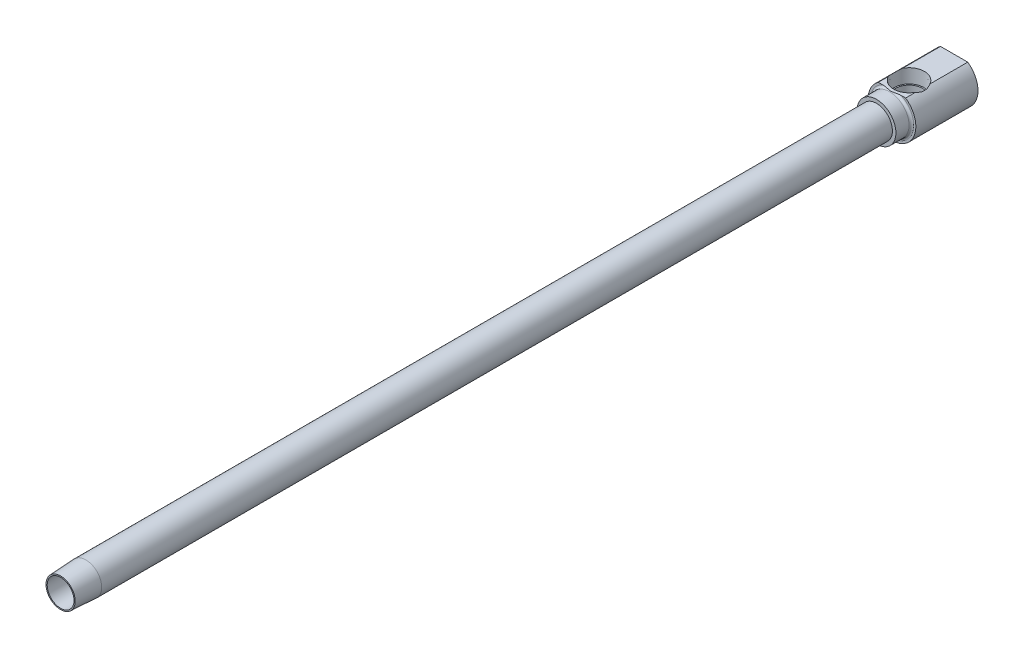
ISO-10303-21;
HEADER;
FILE_DESCRIPTION(('STEP AP214'),'2;1');
FILE_NAME('part.step','',(''),(''),'','','');
FILE_SCHEMA(('AUTOMOTIVE_DESIGN { 1 0 10303 214 1 1 1 1 }'));
ENDSEC;
DATA;
#1=APPLICATION_CONTEXT('core data for automotive mechanical design processes');
#2=APPLICATION_PROTOCOL_DEFINITION('international standard','automotive_design',2000,#1);
#3=PRODUCT_CONTEXT('',#1,'mechanical');
#4=PRODUCT('Part','Part','',(#3));
#5=PRODUCT_RELATED_PRODUCT_CATEGORY('part','',(#4));
#6=PRODUCT_DEFINITION_FORMATION('','',#4);
#7=PRODUCT_DEFINITION_CONTEXT('part definition',#1,'design');
#8=PRODUCT_DEFINITION('design','',#6,#7);
#9=PRODUCT_DEFINITION_SHAPE('','',#8);
#10=(LENGTH_UNIT() NAMED_UNIT(*) SI_UNIT(.MILLI.,.METRE.));
#11=(NAMED_UNIT(*) PLANE_ANGLE_UNIT() SI_UNIT($,.RADIAN.));
#12=(NAMED_UNIT(*) SI_UNIT($,.STERADIAN.) SOLID_ANGLE_UNIT());
#13=UNCERTAINTY_MEASURE_WITH_UNIT(LENGTH_MEASURE(1.E-05),#10,'distance_accuracy_value','');
#14=(GEOMETRIC_REPRESENTATION_CONTEXT(3) GLOBAL_UNCERTAINTY_ASSIGNED_CONTEXT((#13)) GLOBAL_UNIT_ASSIGNED_CONTEXT((#10,
#11,#12)) REPRESENTATION_CONTEXT('',''));
#15=CARTESIAN_POINT('',(0.,0.,0.));
#16=DIRECTION('',(0.,0.,1.));
#17=DIRECTION('',(1.,0.,0.));
#18=AXIS2_PLACEMENT_3D('',#15,#16,#17);
#19=CARTESIAN_POINT('',(-4.3815,0.,0.));
#20=DIRECTION('',(0.,0.,1.));
#21=DIRECTION('',(1.,0.,0.));
#22=AXIS2_PLACEMENT_3D('',#19,#20,#21);
#23=PLANE('',#22);
#24=CARTESIAN_POINT('',(0.,0.,0.));
#25=DIRECTION('',(0.,0.,-1.));
#26=DIRECTION('',(-1.,0.,0.));
#27=AXIS2_PLACEMENT_3D('',#24,#25,#26);
#28=CIRCLE('',#27,4.3815);
#29=CARTESIAN_POINT('',(-4.3815,0.,0.));
#30=VERTEX_POINT('',#29);
#31=EDGE_CURVE('E18',#30,#30,#28,.T.);
#32=ORIENTED_EDGE('',*,*,#31,.T.);
#33=EDGE_LOOP('',(#32));
#34=FACE_BOUND('',#33,.T.);
#35=CARTESIAN_POINT('',(0.,0.,0.));
#36=DIRECTION('',(0.,0.,-1.));
#37=DIRECTION('',(-1.,0.,0.));
#38=AXIS2_PLACEMENT_3D('',#35,#36,#37);
#39=CIRCLE('',#38,4.7752);
#40=CARTESIAN_POINT('',(-4.7752,0.,0.));
#41=VERTEX_POINT('',#40);
#42=EDGE_CURVE('E148',#41,#41,#39,.T.);
#43=ORIENTED_EDGE('',*,*,#42,.F.);
#44=EDGE_LOOP('',(#43));
#45=FACE_BOUND('',#44,.T.);
#46=ADVANCED_FACE('F15',(#34,#45),#23,.T.);
#47=CARTESIAN_POINT('',(0.,0.,-333.972366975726));
#48=DIRECTION('',(0.,0.,-1.));
#49=DIRECTION('',(-1.,0.,0.));
#50=AXIS2_PLACEMENT_3D('',#47,#48,#49);
#51=CYLINDRICAL_SURFACE('',#50,5.207);
#52=CARTESIAN_POINT('',(0.,0.,-8.23923482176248));
#53=DIRECTION('',(0.,0.,-1.));
#54=DIRECTION('',(-1.,0.,0.));
#55=AXIS2_PLACEMENT_3D('',#52,#53,#54);
#56=CIRCLE('',#55,5.207);
#57=CARTESIAN_POINT('',(-5.207,0.,-8.23923482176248));
#58=VERTEX_POINT('',#57);
#59=EDGE_CURVE('E150',#58,#58,#56,.T.);
#60=ORIENTED_EDGE('',*,*,#59,.T.);
#61=EDGE_LOOP('',(#60));
#62=FACE_BOUND('',#61,.T.);
#63=CARTESIAN_POINT('',(0.,0.,-266.7254));
#64=DIRECTION('',(0.,0.,-1.));
#65=DIRECTION('',(-1.,0.,0.));
#66=AXIS2_PLACEMENT_3D('',#63,#64,#65);
#67=CIRCLE('',#66,5.207);
#68=CARTESIAN_POINT('',(-5.207,0.,-266.7254));
#69=VERTEX_POINT('',#68);
#70=EDGE_CURVE('E240',#69,#69,#67,.T.);
#71=ORIENTED_EDGE('',*,*,#70,.F.);
#72=EDGE_LOOP('',(#71));
#73=FACE_BOUND('',#72,.T.);
#74=ADVANCED_FACE('F135',(#62,#73),#51,.T.);
#75=CARTESIAN_POINT('',(-4.4577,6.41348742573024,-258.7752));
#76=DIRECTION('',(0.,-1.,0.));
#77=DIRECTION('',(0.,0.,-1.));
#78=AXIS2_PLACEMENT_3D('',#75,#76,#77);
#79=PLANE('',#78);
#80=DIRECTION('',(0.,0.,-1.));
#81=VECTOR('',#80,1.);
#82=CARTESIAN_POINT('',(4.4577,6.41348742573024,-258.7752));
#83=LINE('',#82,#81);
#84=CARTESIAN_POINT('',(4.4577,6.41348742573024,-271.78));
#85=VERTEX_POINT('',#84);
#86=CARTESIAN_POINT('',(4.4577,6.41348742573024,-275.021408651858));
#87=VERTEX_POINT('',#86);
#88=EDGE_CURVE('E293',#85,#87,#83,.T.);
#89=ORIENTED_EDGE('',*,*,#88,.T.);
#90=CARTESIAN_POINT('',(0.,6.41348742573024,-277.368));
#91=DIRECTION('',(0.,-1.,0.));
#92=DIRECTION('',(0.,0.,-1.));
#93=AXIS2_PLACEMENT_3D('',#90,#91,#92);
#94=CIRCLE('',#93,5.03761652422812);
#95=CARTESIAN_POINT('',(-4.4577,6.41348742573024,-275.021408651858));
#96=VERTEX_POINT('',#95);
#97=EDGE_CURVE('E157',#87,#96,#94,.T.);
#98=ORIENTED_EDGE('',*,*,#97,.T.);
#99=DIRECTION('',(0.,0.,-1.));
#100=VECTOR('',#99,1.);
#101=CARTESIAN_POINT('',(-4.4577,6.41348742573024,-258.7752));
#102=LINE('',#101,#100);
#103=CARTESIAN_POINT('',(-4.4577,6.41348742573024,-271.78));
#104=VERTEX_POINT('',#103);
#105=EDGE_CURVE('E291',#104,#96,#102,.T.);
#106=ORIENTED_EDGE('',*,*,#105,.F.);
#107=DIRECTION('',(1.,0.,0.));
#108=VECTOR('',#107,1.);
#109=CARTESIAN_POINT('',(-7.112,6.41348742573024,-271.78));
#110=LINE('',#109,#108);
#111=CARTESIAN_POINT('',(-3.07371485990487,6.41348742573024,-271.78));
#112=VERTEX_POINT('',#111);
#113=EDGE_CURVE('E282',#104,#112,#110,.T.);
#114=ORIENTED_EDGE('',*,*,#113,.T.);
#115=CARTESIAN_POINT('',(0.,6.41348742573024,-271.322506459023));
#116=CARTESIAN_POINT('',(0.0547669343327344,6.41348742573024,-271.322502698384));
#117=CARTESIAN_POINT('',(0.10953094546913,6.41348742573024,-271.324131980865));
#118=CARTESIAN_POINT('',(0.218888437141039,6.41348742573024,-271.330434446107));
#119=CARTESIAN_POINT('',(0.273481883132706,6.41348742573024,-271.33510820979));
#120=CARTESIAN_POINT('',(0.437133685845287,6.41348742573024,-271.352954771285));
#121=CARTESIAN_POINT('',(0.545759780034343,6.41348742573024,-271.369948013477));
#122=CARTESIAN_POINT('',(0.763468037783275,6.41348742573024,-271.409460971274));
#123=CARTESIAN_POINT('',(0.872535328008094,6.41348742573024,-271.432054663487));
#124=CARTESIAN_POINT('',(1.09015205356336,6.41348742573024,-271.479005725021));
#125=CARTESIAN_POINT('',(1.19870193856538,6.41348742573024,-271.50336104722));
#126=CARTESIAN_POINT('',(1.441224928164,6.41348742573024,-271.557231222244));
#127=CARTESIAN_POINT('',(1.57522547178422,6.41348742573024,-271.586625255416));
#128=CARTESIAN_POINT('',(1.84407607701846,6.41348742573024,-271.641759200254));
#129=CARTESIAN_POINT('',(1.97892653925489,6.41348742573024,-271.667497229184));
#130=CARTESIAN_POINT('',(2.24890278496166,6.41348742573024,-271.712646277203));
#131=CARTESIAN_POINT('',(2.38402236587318,6.41348742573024,-271.732093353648));
#132=CARTESIAN_POINT('',(2.6552179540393,6.41348742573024,-271.762201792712));
#133=CARTESIAN_POINT('',(2.79129309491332,6.41348742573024,-271.772870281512));
#134=CARTESIAN_POINT('',(2.99640645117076,6.41348742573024,-271.779807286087));
#135=CARTESIAN_POINT('',(3.06529255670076,6.41348742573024,-271.780589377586));
#136=CARTESIAN_POINT('',(3.20300193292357,6.41348742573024,-271.778500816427));
#137=CARTESIAN_POINT('',(3.27182521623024,6.41348742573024,-271.775631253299));
#138=CARTESIAN_POINT('',(3.40907712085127,6.41348742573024,-271.765580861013));
#139=CARTESIAN_POINT('',(3.47750615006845,6.41348742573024,-271.758405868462));
#140=CARTESIAN_POINT('',(3.61360674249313,6.41348742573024,-271.738913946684));
#141=CARTESIAN_POINT('',(3.68127881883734,6.41348742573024,-271.726600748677));
#142=CARTESIAN_POINT('',(3.81134745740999,6.41348742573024,-271.696638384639));
#143=CARTESIAN_POINT('',(3.8738228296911,6.41348742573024,-271.679338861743));
#144=CARTESIAN_POINT('',(3.99661419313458,6.41348742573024,-271.637990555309));
#145=CARTESIAN_POINT('',(4.05692926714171,6.41348742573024,-271.613938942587));
#146=CARTESIAN_POINT('',(4.16438836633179,6.41348742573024,-271.561987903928));
#147=CARTESIAN_POINT('',(4.21210790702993,6.41348742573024,-271.535296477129));
#148=CARTESIAN_POINT('',(4.30289303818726,6.41348742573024,-271.474877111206));
#149=CARTESIAN_POINT('',(4.34597104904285,6.41348742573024,-271.441168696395));
#150=CARTESIAN_POINT('',(4.40881816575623,6.41348742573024,-271.380664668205));
#151=CARTESIAN_POINT('',(4.43105110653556,6.41348742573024,-271.356438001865));
#152=CARTESIAN_POINT('',(4.47168650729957,6.41348742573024,-271.304939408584));
#153=CARTESIAN_POINT('',(4.49009362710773,6.41348742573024,-271.277671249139));
#154=CARTESIAN_POINT('',(4.51921410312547,6.41348742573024,-271.22504266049));
#155=CARTESIAN_POINT('',(4.53069614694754,6.41348742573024,-271.200111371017));
#156=CARTESIAN_POINT('',(4.54935954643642,6.41348742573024,-271.14867800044));
#157=CARTESIAN_POINT('',(4.55654415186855,6.41348742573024,-271.122177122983));
#158=CARTESIAN_POINT('',(4.56604079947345,6.41348742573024,-271.068144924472));
#159=CARTESIAN_POINT('',(4.56832514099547,6.41348742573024,-271.040608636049));
#160=CARTESIAN_POINT('',(4.56771494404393,6.41348742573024,-270.985594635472));
#161=CARTESIAN_POINT('',(4.56482077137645,6.41348742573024,-270.958116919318));
#162=CARTESIAN_POINT('',(4.55461750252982,6.41348742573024,-270.906573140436));
#163=CARTESIAN_POINT('',(4.54772671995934,6.41348742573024,-270.882421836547));
#164=CARTESIAN_POINT('',(4.53037439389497,6.41348742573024,-270.835451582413));
#165=CARTESIAN_POINT('',(4.51991160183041,6.41348742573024,-270.812633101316));
#166=CARTESIAN_POINT('',(4.49089034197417,6.41348742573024,-270.759253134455));
#167=CARTESIAN_POINT('',(4.4707819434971,6.41348742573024,-270.729535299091));
#168=CARTESIAN_POINT('',(4.4260781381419,6.41348742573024,-270.673694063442));
#169=CARTESIAN_POINT('',(4.4014723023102,6.41348742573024,-270.6475792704));
#170=CARTESIAN_POINT('',(4.33512083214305,6.41348742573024,-270.585846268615));
#171=CARTESIAN_POINT('',(4.2912196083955,6.41348742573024,-270.552560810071));
#172=CARTESIAN_POINT('',(4.19894894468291,6.41348742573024,-270.492992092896));
#173=CARTESIAN_POINT('',(4.15057028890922,6.41348742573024,-270.466723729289));
#174=CARTESIAN_POINT('',(4.05679374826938,6.41348742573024,-270.422729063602));
#175=CARTESIAN_POINT('',(4.01168660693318,6.41348742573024,-270.404369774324));
#176=CARTESIAN_POINT('',(3.92005010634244,6.41348742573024,-270.371582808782));
#177=CARTESIAN_POINT('',(3.87351963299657,6.41348742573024,-270.357158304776));
#178=CARTESIAN_POINT('',(3.73245646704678,6.41348742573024,-270.318915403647));
#179=CARTESIAN_POINT('',(3.63654836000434,6.41348742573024,-270.3001691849));
#180=CARTESIAN_POINT('',(3.44110716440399,6.41348742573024,-270.272600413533));
#181=CARTESIAN_POINT('',(3.34154251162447,6.41348742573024,-270.264028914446));
#182=CARTESIAN_POINT('',(3.14195452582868,6.41348742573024,-270.255217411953));
#183=CARTESIAN_POINT('',(3.04193075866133,6.41348742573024,-270.254988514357));
#184=CARTESIAN_POINT('',(2.84160218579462,6.41348742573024,-270.261135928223));
#185=CARTESIAN_POINT('',(2.74129862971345,6.41348742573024,-270.26754664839));
#186=CARTESIAN_POINT('',(2.54132534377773,6.41348742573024,-270.285618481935));
#187=CARTESIAN_POINT('',(2.4416549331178,6.41348742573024,-270.297272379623));
#188=CARTESIAN_POINT('',(2.13711894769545,6.41348742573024,-270.339263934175));
#189=CARTESIAN_POINT('',(1.93319771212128,6.41348742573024,-270.37628574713));
#190=CARTESIAN_POINT('',(1.62827949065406,6.41348742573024,-270.438357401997));
#191=CARTESIAN_POINT('',(1.52655364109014,6.41348742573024,-270.460199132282));
#192=CARTESIAN_POINT('',(1.32330984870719,6.41348742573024,-270.50483124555));
#193=CARTESIAN_POINT('',(1.22179189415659,6.41348742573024,-270.527621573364));
#194=CARTESIAN_POINT('',(1.02058637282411,6.41348742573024,-270.57212134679));
#195=CARTESIAN_POINT('',(0.920901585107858,6.41348742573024,-270.59384319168));
#196=CARTESIAN_POINT('',(0.720902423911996,6.41348742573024,-270.63448684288));
#197=CARTESIAN_POINT('',(0.620587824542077,6.41348742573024,-270.653407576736));
#198=CARTESIAN_POINT('',(0.419827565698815,6.41348742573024,-270.684865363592));
#199=CARTESIAN_POINT('',(0.319392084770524,6.41348742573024,-270.697460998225));
#200=CARTESIAN_POINT('',(0.168224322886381,6.41348742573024,-270.708901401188));
#201=CARTESIAN_POINT('',(0.117779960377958,6.41348742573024,-270.711473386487));
#202=CARTESIAN_POINT('',(0.0168277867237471,6.41348742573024,-270.71389611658));
#203=CARTESIAN_POINT('',(-0.0336800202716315,6.41348742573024,-270.713747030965));
#204=CARTESIAN_POINT('',(-0.167203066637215,6.41348742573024,-270.709734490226));
#205=CARTESIAN_POINT('',(-0.250151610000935,6.41348742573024,-270.703534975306));
#206=CARTESIAN_POINT('',(-0.415406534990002,6.41348742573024,-270.685308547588));
#207=CARTESIAN_POINT('',(-0.497712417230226,6.41348742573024,-270.673277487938));
#208=CARTESIAN_POINT('',(-0.66236408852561,6.41348742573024,-270.645484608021));
#209=CARTESIAN_POINT('',(-0.744704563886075,6.41348742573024,-270.629692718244));
#210=CARTESIAN_POINT('',(-0.908954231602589,6.41348742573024,-270.596225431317));
#211=CARTESIAN_POINT('',(-0.990863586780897,6.41348742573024,-270.578550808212));
#212=CARTESIAN_POINT('',(-1.15599570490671,6.41348742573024,-270.5422569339));
#213=CARTESIAN_POINT('',(-1.23921597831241,6.41348742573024,-270.523626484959));
#214=CARTESIAN_POINT('',(-1.40572088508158,6.41348742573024,-270.486671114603));
#215=CARTESIAN_POINT('',(-1.48900551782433,6.41348742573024,-270.46834619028));
#216=CARTESIAN_POINT('',(-1.73866654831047,6.41348742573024,-270.415071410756));
#217=CARTESIAN_POINT('',(-1.90540243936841,6.41348742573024,-270.38168897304));
#218=CARTESIAN_POINT('',(-2.16681921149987,6.41348742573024,-270.336734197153));
#219=CARTESIAN_POINT('',(-2.26095047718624,6.41348742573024,-270.322025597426));
#220=CARTESIAN_POINT('',(-2.44971550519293,6.41348742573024,-270.296348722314));
#221=CARTESIAN_POINT('',(-2.5443491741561,6.41348742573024,-270.285379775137));
#222=CARTESIAN_POINT('',(-2.73368335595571,6.41348742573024,-270.268201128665));
#223=CARTESIAN_POINT('',(-2.82838206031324,6.41348742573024,-270.261972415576));
#224=CARTESIAN_POINT('',(-3.01793602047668,6.41348742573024,-270.255372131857));
#225=CARTESIAN_POINT('',(-3.11279113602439,6.41348742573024,-270.254996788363));
#226=CARTESIAN_POINT('',(-3.31218734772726,6.41348742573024,-270.261898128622));
#227=CARTESIAN_POINT('',(-3.41671052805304,6.41348742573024,-270.26997414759));
#228=CARTESIAN_POINT('',(-3.5723466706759,6.41348742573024,-270.290810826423));
#229=CARTESIAN_POINT('',(-3.62404703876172,6.41348742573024,-270.299213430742));
#230=CARTESIAN_POINT('',(-3.72677708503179,6.41348742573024,-270.319392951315));
#231=CARTESIAN_POINT('',(-3.77780699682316,6.41348742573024,-270.331168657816));
#232=CARTESIAN_POINT('',(-3.89634421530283,6.41348742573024,-270.363403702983));
#233=CARTESIAN_POINT('',(-3.96343170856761,6.41348742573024,-270.385458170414));
#234=CARTESIAN_POINT('',(-4.09405850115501,6.41348742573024,-270.438413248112));
#235=CARTESIAN_POINT('',(-4.1576046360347,6.41348742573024,-270.469296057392));
#236=CARTESIAN_POINT('',(-4.25441976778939,6.41348742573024,-270.527888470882));
#237=CARTESIAN_POINT('',(-4.28979385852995,6.41348742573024,-270.552097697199));
#238=CARTESIAN_POINT('',(-4.35685699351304,6.41348742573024,-270.605223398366));
#239=CARTESIAN_POINT('',(-4.38855051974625,6.41348742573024,-270.63413404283));
#240=CARTESIAN_POINT('',(-4.4393789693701,6.41348742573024,-270.689413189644));
#241=CARTESIAN_POINT('',(-4.45969325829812,6.41348742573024,-270.71468864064));
#242=CARTESIAN_POINT('',(-4.49606293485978,6.41348742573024,-270.76815327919));
#243=CARTESIAN_POINT('',(-4.51212457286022,6.41348742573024,-270.796338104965));
#244=CARTESIAN_POINT('',(-4.53626721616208,6.41348742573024,-270.849729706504));
#245=CARTESIAN_POINT('',(-4.54527744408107,6.41348742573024,-270.874513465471));
#246=CARTESIAN_POINT('',(-4.5590260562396,6.41348742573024,-270.925243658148));
#247=CARTESIAN_POINT('',(-4.56376753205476,6.41348742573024,-270.951189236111));
#248=CARTESIAN_POINT('',(-4.56859445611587,6.41348742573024,-271.003605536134));
#249=CARTESIAN_POINT('',(-4.5686642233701,6.41348742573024,-271.030077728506));
#250=CARTESIAN_POINT('',(-4.56410153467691,6.41348742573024,-271.082612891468));
#251=CARTESIAN_POINT('',(-4.55946793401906,6.41348742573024,-271.108675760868));
#252=CARTESIAN_POINT('',(-4.54620785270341,6.41348742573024,-271.158450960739));
#253=CARTESIAN_POINT('',(-4.5377761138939,6.41348742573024,-271.18221625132));
#254=CARTESIAN_POINT('',(-4.51754524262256,6.41348742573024,-271.228251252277));
#255=CARTESIAN_POINT('',(-4.50574488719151,6.41348742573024,-271.250520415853));
#256=CARTESIAN_POINT('',(-4.47265204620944,6.41348742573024,-271.304236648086));
#257=CARTESIAN_POINT('',(-4.44958451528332,6.41348742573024,-271.334590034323));
#258=CARTESIAN_POINT('',(-4.3989344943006,6.41348742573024,-271.391262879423));
#259=CARTESIAN_POINT('',(-4.37134039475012,6.41348742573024,-271.417571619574));
#260=CARTESIAN_POINT('',(-4.2963776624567,6.41348742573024,-271.480336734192));
#261=CARTESIAN_POINT('',(-4.24670632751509,6.41348742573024,-271.514023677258));
#262=CARTESIAN_POINT('',(-4.14294758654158,6.41348742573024,-271.573603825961));
#263=CARTESIAN_POINT('',(-4.08885088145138,6.41348742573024,-271.5994800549));
#264=CARTESIAN_POINT('',(-3.98330416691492,6.41348742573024,-271.64266584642));
#265=CARTESIAN_POINT('',(-3.93208515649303,6.41348742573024,-271.660552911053));
#266=CARTESIAN_POINT('',(-3.82828626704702,6.41348742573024,-271.691892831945));
#267=CARTESIAN_POINT('',(-3.77570527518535,6.41348742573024,-271.705341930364));
#268=CARTESIAN_POINT('',(-3.66966451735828,6.41348742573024,-271.728467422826));
#269=CARTESIAN_POINT('',(-3.61620370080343,6.41348742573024,-271.738138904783));
#270=CARTESIAN_POINT('',(-3.5088236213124,6.41348742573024,-271.754213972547));
#271=CARTESIAN_POINT('',(-3.45490452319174,6.41348742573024,-271.760618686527));
#272=CARTESIAN_POINT('',(-3.3289301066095,6.41348742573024,-271.772254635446));
#273=CARTESIAN_POINT('',(-3.25677506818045,6.41348742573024,-271.776396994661));
#274=CARTESIAN_POINT('',(-3.11233636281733,6.41348742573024,-271.780499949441));
#275=CARTESIAN_POINT('',(-3.04005265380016,6.41348742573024,-271.780458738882));
#276=CARTESIAN_POINT('',(-2.82311145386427,6.41348742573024,-271.775065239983));
#277=CARTESIAN_POINT('',(-2.67858508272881,6.41348742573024,-271.764427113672));
#278=CARTESIAN_POINT('',(-2.3894134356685,6.41348742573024,-271.733026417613));
#279=CARTESIAN_POINT('',(-2.24477928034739,6.41348742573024,-271.712171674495));
#280=CARTESIAN_POINT('',(-1.95690250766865,6.41348742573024,-271.663578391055));
#281=CARTESIAN_POINT('',(-1.81365833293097,6.41348742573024,-271.635848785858));
#282=CARTESIAN_POINT('',(-1.53108031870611,6.41348742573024,-271.577154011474));
#283=CARTESIAN_POINT('',(-1.39172865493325,6.41348742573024,-271.54627129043));
#284=CARTESIAN_POINT('',(-1.18259583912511,6.41348742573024,-271.499745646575));
#285=CARTESIAN_POINT('',(-1.11279428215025,6.41348742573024,-271.484187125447));
#286=CARTESIAN_POINT('',(-0.973069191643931,6.41348742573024,-271.453631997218));
#287=CARTESIAN_POINT('',(-0.903145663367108,6.41348742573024,-271.438635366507));
#288=CARTESIAN_POINT('',(-0.764296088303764,6.41348742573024,-271.410259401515));
#289=CARTESIAN_POINT('',(-0.69537516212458,6.41348742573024,-271.396855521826));
#290=CARTESIAN_POINT('',(-0.55710522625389,6.41348742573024,-271.372372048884));
#291=CARTESIAN_POINT('',(-0.487756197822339,6.41348742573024,-271.361292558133));
#292=CARTESIAN_POINT('',(-0.348841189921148,6.41348742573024,-271.342764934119));
#293=CARTESIAN_POINT('',(-0.279277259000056,6.41348742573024,-271.335302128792));
#294=CARTESIAN_POINT('',(-0.139807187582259,6.41348742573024,-271.325176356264));
#295=CARTESIAN_POINT('',(-0.0699012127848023,6.41348742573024,-271.322511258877));
#296=CARTESIAN_POINT('',(0.,6.41348742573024,-271.322506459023));
#297=B_SPLINE_CURVE_WITH_KNOTS('',3,(#115,#116,#117,#118,#119,#120,#121,#122,#123,#124,#125,
#126,#127,#128,#129,#130,#131,#132,#133,#134,#135,#136,#137,#138,#139,#140,#141,#142,#143,#144,
#145,#146,#147,#148,#149,#150,#151,#152,#153,#154,#155,#156,#157,#158,#159,#160,#161,#162,#163,
#164,#165,#166,#167,#168,#169,#170,#171,#172,#173,#174,#175,#176,#177,#178,#179,#180,#181,#182,
#183,#184,#185,#186,#187,#188,#189,#190,#191,#192,#193,#194,#195,#196,#197,#198,#199,#200,#201,
#202,#203,#204,#205,#206,#207,#208,#209,#210,#211,#212,#213,#214,#215,#216,#217,#218,#219,#220,
#221,#222,#223,#224,#225,#226,#227,#228,#229,#230,#231,#232,#233,#234,#235,#236,#237,#238,#239,
#240,#241,#242,#243,#244,#245,#246,#247,#248,#249,#250,#251,#252,#253,#254,#255,#256,#257,#258,
#259,#260,#261,#262,#263,#264,#265,#266,#267,#268,#269,#270,#271,#272,#273,#274,#275,#276,#277,
#278,#279,#280,#281,#282,#283,#284,#285,#286,#287,#288,#289,#290,#291,#292,#293,#294,#295,#296),
.UNSPECIFIED.,.T.,.F.,(4,2,2,2,2,2,2,2,2,2,2,2,2,2,2,2,2,2,2,2,2,2,2,2,2,2,2,2,2,2,2,2,2,2,2,2,
2,2,2,2,2,2,2,2,2,2,2,2,2,2,2,2,2,2,2,2,2,2,2,2,2,2,2,2,2,2,2,2,2,2,2,2,2,2,2,2,2,2,2,2,2,2,2,2,
2,2,2,2,2,2,4),(0.,0.164273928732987,0.32857921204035,0.658096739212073,0.992223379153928,
1.32596779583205,1.73751584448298,2.14927506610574,2.55863060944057,2.96765352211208,
3.17424892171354,3.38078269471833,3.58703711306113,3.79314201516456,3.98733137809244,
4.18160222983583,4.34518473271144,4.50831802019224,4.60668262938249,4.70492671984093,
4.78693922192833,4.86888962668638,4.95130208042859,5.03370871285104,5.10874003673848,
5.18379761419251,5.29083718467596,5.398128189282,5.56248306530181,5.72718409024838,
5.87307196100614,6.01907710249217,6.31139884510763,6.61079267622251,6.91058505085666,
7.21193886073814,7.51287920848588,8.13412004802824,8.44626765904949,8.75839714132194,
9.06445930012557,9.37063833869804,9.67392675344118,9.82538795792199,9.97683972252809,
10.2260774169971,10.4754926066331,10.7269732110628,10.9783508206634,11.2341897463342,
11.4900262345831,11.9999950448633,12.2857569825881,12.5714675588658,12.8560259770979,
13.1404009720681,13.4543312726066,13.6113768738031,13.7683662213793,13.9797728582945,
14.1907561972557,14.3190471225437,14.4471801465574,14.5441362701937,14.6409490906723,
14.7197308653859,14.7984555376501,14.8774444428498,14.9564525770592,15.0318037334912,
15.1071822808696,15.2209045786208,15.3349232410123,15.5139662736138,15.6933957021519,
15.8559161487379,16.0185738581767,16.1814423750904,16.3442546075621,16.5609200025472,
16.7776789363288,17.2118589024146,17.6500302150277,18.0876350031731,18.5158248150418,
18.7303690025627,18.9449041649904,19.1555191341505,19.3661433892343,19.5759058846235,
19.7855752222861),.UNSPECIFIED.);
#298=CARTESIAN_POINT('',(3.07371485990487,6.41348742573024,-271.78));
#299=VERTEX_POINT('',#298);
#300=EDGE_CURVE('E232',#112,#299,#297,.T.);
#301=ORIENTED_EDGE('',*,*,#300,.T.);
#302=EDGE_CURVE('E297',#299,#85,#110,.T.);
#303=ORIENTED_EDGE('',*,*,#302,.T.);
#304=EDGE_LOOP('',(#89,#98,#106,#114,#301,#303));
#305=FACE_BOUND('',#304,.T.);
#306=ADVANCED_FACE('F141',(#305),#79,.F.);
#307=CARTESIAN_POINT('',(0.,0.,-333.972366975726));
#308=DIRECTION('',(0.,0.,-1.));
#309=DIRECTION('',(-1.,0.,0.));
#310=AXIS2_PLACEMENT_3D('',#307,#308,#309);
#311=CYLINDRICAL_SURFACE('',#310,4.3815);
#312=ORIENTED_EDGE('',*,*,#31,.F.);
#313=EDGE_LOOP('',(#312));
#314=FACE_BOUND('',#313,.T.);
#315=CARTESIAN_POINT('',(0.,0.,-266.7254));
#316=DIRECTION('',(0.,0.,-1.));
#317=DIRECTION('',(-1.,0.,0.));
#318=AXIS2_PLACEMENT_3D('',#315,#316,#317);
#319=CIRCLE('',#318,4.3815);
#320=CARTESIAN_POINT('',(-3.16538744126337,-3.02949906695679,-266.7254));
#321=VERTEX_POINT('',#320);
#322=CARTESIAN_POINT('',(3.16538744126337,-3.02949906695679,-266.7254));
#323=VERTEX_POINT('',#322);
#324=EDGE_CURVE('E235',#321,#323,#319,.T.);
#325=ORIENTED_EDGE('',*,*,#324,.T.);
#326=CARTESIAN_POINT('',(3.16547479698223,-3.02940779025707,-266.7256));
#327=CARTESIAN_POINT('',(3.14342446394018,-3.05243943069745,-266.675077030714));
#328=CARTESIAN_POINT('',(3.11972293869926,-3.07670954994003,-266.625848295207));
#329=CARTESIAN_POINT('',(3.06888207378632,-3.12742914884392,-266.530394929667));
#330=CARTESIAN_POINT('',(3.04174325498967,-3.15387829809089,-266.484169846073));
#331=CARTESIAN_POINT('',(2.95559153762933,-3.23545829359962,-266.351577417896));
#332=CARTESIAN_POINT('',(2.89136505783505,-3.29334010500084,-266.270167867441));
#333=CARTESIAN_POINT('',(2.75011359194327,-3.41217163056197,-266.122271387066));
#334=CARTESIAN_POINT('',(2.67308610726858,-3.47312194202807,-266.05578737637));
#335=CARTESIAN_POINT('',(2.5081918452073,-3.59402230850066,-265.93634210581));
#336=CARTESIAN_POINT('',(2.42029620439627,-3.653969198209,-265.883418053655));
#337=CARTESIAN_POINT('',(2.25775713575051,-3.75593106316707,-265.800236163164));
#338=CARTESIAN_POINT('',(2.18486784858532,-3.79884421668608,-265.767575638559));
#339=CARTESIAN_POINT('',(2.0348886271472,-3.88124850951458,-265.707990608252));
#340=CARTESIAN_POINT('',(1.95779677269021,-3.92073806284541,-265.681068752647));
#341=CARTESIAN_POINT('',(1.80004579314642,-3.99562399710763,-265.632117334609));
#342=CARTESIAN_POINT('',(1.71938265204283,-4.03101559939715,-265.610093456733));
#343=CARTESIAN_POINT('',(1.55515017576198,-4.09718246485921,-265.570304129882));
#344=CARTESIAN_POINT('',(1.47157967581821,-4.12795585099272,-265.552540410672));
#345=CARTESIAN_POINT('',(1.21289030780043,-4.21425858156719,-265.504005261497));
#346=CARTESIAN_POINT('',(1.03389313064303,-4.26180132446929,-265.479192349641));
#347=CARTESIAN_POINT('',(0.670227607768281,-4.33390350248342,-265.442389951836));
#348=CARTESIAN_POINT('',(0.485562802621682,-4.35847699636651,-265.430392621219));
#349=CARTESIAN_POINT('',(0.191999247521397,-4.37863265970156,-265.420580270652));
#350=CARTESIAN_POINT('',(0.0836976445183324,-4.38203983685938,-265.41893316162));
#351=CARTESIAN_POINT('',(-0.132842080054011,-4.38082235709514,-265.419520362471));
#352=CARTESIAN_POINT('',(-0.241080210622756,-4.37619962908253,-265.421753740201));
#353=CARTESIAN_POINT('',(-0.456961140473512,-4.35895390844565,-265.430180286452));
#354=CARTESIAN_POINT('',(-0.564602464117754,-4.34631610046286,-265.436380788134));
#355=CARTESIAN_POINT('',(-0.778298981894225,-4.31317491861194,-265.45296127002));
#356=CARTESIAN_POINT('',(-0.8843548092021,-4.29267477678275,-265.463339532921));
#357=CARTESIAN_POINT('',(-1.09632494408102,-4.24354696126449,-265.488913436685));
#358=CARTESIAN_POINT('',(-1.20219105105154,-4.21476010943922,-265.504204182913));
#359=CARTESIAN_POINT('',(-1.41060084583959,-4.14965783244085,-265.540134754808));
#360=CARTESIAN_POINT('',(-1.51314609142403,-4.11334599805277,-265.560772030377));
#361=CARTESIAN_POINT('',(-1.71390456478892,-4.03381995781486,-265.608258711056));
#362=CARTESIAN_POINT('',(-1.81212318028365,-3.99061466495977,-265.635100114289));
#363=CARTESIAN_POINT('',(-2.00320334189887,-3.8982035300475,-265.696192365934));
#364=CARTESIAN_POINT('',(-2.09606839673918,-3.84900168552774,-265.730438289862));
#365=CARTESIAN_POINT('',(-2.29534319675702,-3.73428068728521,-265.816661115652));
#366=CARTESIAN_POINT('',(-2.40014619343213,-3.66757137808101,-265.870889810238));
#367=CARTESIAN_POINT('',(-2.5474831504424,-3.5653153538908,-265.964688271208));
#368=CARTESIAN_POINT('',(-2.59488453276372,-3.5309200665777,-265.99796870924));
#369=CARTESIAN_POINT('',(-2.68608105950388,-3.46204578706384,-266.069051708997));
#370=CARTESIAN_POINT('',(-2.72987823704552,-3.42756685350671,-266.106851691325));
#371=CARTESIAN_POINT('',(-2.81247040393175,-3.36010888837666,-266.186220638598));
#372=CARTESIAN_POINT('',(-2.85136068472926,-3.32711374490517,-266.227676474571));
#373=CARTESIAN_POINT('',(-2.92505072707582,-3.26251751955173,-266.315085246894));
#374=CARTESIAN_POINT('',(-2.95985031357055,-3.23091649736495,-266.361038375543));
#375=CARTESIAN_POINT('',(-3.02566242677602,-3.16938090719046,-266.457865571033));
#376=CARTESIAN_POINT('',(-3.05661307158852,-3.13947696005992,-266.508801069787));
#377=CARTESIAN_POINT('',(-3.11423662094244,-3.0823220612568,-266.614485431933));
#378=CARTESIAN_POINT('',(-3.1409073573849,-3.05507245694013,-266.669236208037));
#379=CARTESIAN_POINT('',(-3.16547479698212,-3.02940779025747,-266.7256));
#380=B_SPLINE_CURVE_WITH_KNOTS('',3,(#326,#327,#328,#329,#330,#331,#332,#333,#334,#335,#336,
#337,#338,#339,#340,#341,#342,#343,#344,#345,#346,#347,#348,#349,#350,#351,#352,#353,#354,#355,
#356,#357,#358,#359,#360,#361,#362,#363,#364,#365,#366,#367,#368,#369,#370,#371,#372,#373,#374,
#375,#376,#377,#378,#379),.UNSPECIFIED.,.F.,.F.,(4,2,2,2,2,2,2,2,2,2,2,2,2,2,2,2,2,2,2,2,2,2,2,
2,2,2,4),(0.,0.17915549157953,0.358283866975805,0.712611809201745,1.06700899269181,
1.42236845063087,1.69403668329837,1.96583010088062,2.23793733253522,2.51015486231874,
3.06856026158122,3.62662365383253,3.95140246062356,4.27610326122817,4.60140600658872,
4.9265751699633,5.2584629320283,5.59019268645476,5.92149695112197,6.25258155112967,
6.65760632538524,6.8594893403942,7.06125768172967,7.25815107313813,7.45505288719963,
7.65479552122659,7.85463902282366),.UNSPECIFIED.);
#381=EDGE_CURVE('E203',#323,#321,#380,.T.);
#382=ORIENTED_EDGE('',*,*,#381,.T.);
#383=EDGE_LOOP('',(#325,#382));
#384=FACE_BOUND('',#383,.T.);
#385=ADVANCED_FACE('F234',(#314,#384),#311,.F.);
#386=CARTESIAN_POINT('',(-4.3815,0.,-266.7254));
#387=DIRECTION('',(0.,0.,1.));
#388=DIRECTION('',(1.,0.,0.));
#389=AXIS2_PLACEMENT_3D('',#386,#387,#388);
#390=PLANE('',#389);
#391=ORIENTED_EDGE('',*,*,#324,.F.);
#392=CARTESIAN_POINT('',(0.,-0.364745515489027,-266.7254));
#393=DIRECTION('',(0.,0.,1.));
#394=DIRECTION('',(0.,1.,0.));
#395=AXIS2_PLACEMENT_3D('',#392,#393,#394);
#396=ELLIPSE('',#395,4.20023414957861,4.09504169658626);
#397=EDGE_CURVE('E195',#321,#323,#396,.F.);
#398=ORIENTED_EDGE('',*,*,#397,.T.);
#399=EDGE_LOOP('',(#391,#398));
#400=FACE_BOUND('',#399,.T.);
#401=ADVANCED_FACE('F237',(#400),#390,.T.);
#402=CARTESIAN_POINT('',(-5.207,0.,-266.7254));
#403=DIRECTION('',(0.,0.,1.));
#404=DIRECTION('',(1.,0.,0.));
#405=AXIS2_PLACEMENT_3D('',#402,#403,#404);
#406=PLANE('',#405);
#407=ORIENTED_EDGE('',*,*,#70,.T.);
#408=EDGE_LOOP('',(#407));
#409=FACE_BOUND('',#408,.T.);
#410=CARTESIAN_POINT('',(0.,0.,-266.7254));
#411=DIRECTION('',(0.,0.,-1.));
#412=DIRECTION('',(-1.,0.,0.));
#413=AXIS2_PLACEMENT_3D('',#410,#411,#412);
#414=CIRCLE('',#413,6.35);
#415=CARTESIAN_POINT('',(-6.35,0.,-266.7254));
#416=VERTEX_POINT('',#415);
#417=EDGE_CURVE('E273',#416,#416,#414,.T.);
#418=ORIENTED_EDGE('',*,*,#417,.F.);
#419=EDGE_LOOP('',(#418));
#420=FACE_BOUND('',#419,.T.);
#421=ADVANCED_FACE('F382',(#409,#420),#406,.T.);
#422=CARTESIAN_POINT('',(-7.8105,0.,-292.1));
#423=DIRECTION('',(0.,0.,-1.));
#424=DIRECTION('',(-1.,0.,0.));
#425=AXIS2_PLACEMENT_3D('',#422,#423,#424);
#426=PLANE('',#425);
#427=DIRECTION('',(1.,0.,0.));
#428=VECTOR('',#427,1.);
#429=CARTESIAN_POINT('',(-2.29502505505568,3.9751,-292.1));
#430=LINE('',#429,#428);
#431=CARTESIAN_POINT('',(-2.29502505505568,3.9751,-292.1));
#432=VERTEX_POINT('',#431);
#433=CARTESIAN_POINT('',(2.29502505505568,3.9751,-292.1));
#434=VERTEX_POINT('',#433);
#435=EDGE_CURVE('E236',#432,#434,#430,.T.);
#436=ORIENTED_EDGE('',*,*,#435,.F.);
#437=DIRECTION('',(0.5,0.866025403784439,0.));
#438=VECTOR('',#437,1.);
#439=CARTESIAN_POINT('',(-4.59005011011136,0.,-292.1));
#440=LINE('',#439,#438);
#441=CARTESIAN_POINT('',(-4.59005011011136,0.,-292.1));
#442=VERTEX_POINT('',#441);
#443=EDGE_CURVE('E323',#442,#432,#440,.T.);
#444=ORIENTED_EDGE('',*,*,#443,.F.);
#445=DIRECTION('',(-0.5,0.866025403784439,0.));
#446=VECTOR('',#445,1.);
#447=CARTESIAN_POINT('',(-2.29502505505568,-3.9751,-292.1));
#448=LINE('',#447,#446);
#449=CARTESIAN_POINT('',(-2.29502505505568,-3.9751,-292.1));
#450=VERTEX_POINT('',#449);
#451=EDGE_CURVE('E327',#450,#442,#448,.T.);
#452=ORIENTED_EDGE('',*,*,#451,.F.);
#453=DIRECTION('',(-1.,0.,0.));
#454=VECTOR('',#453,1.);
#455=CARTESIAN_POINT('',(2.29502505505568,-3.9751,-292.1));
#456=LINE('',#455,#454);
#457=CARTESIAN_POINT('',(2.29502505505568,-3.9751,-292.1));
#458=VERTEX_POINT('',#457);
#459=EDGE_CURVE('E330',#458,#450,#456,.T.);
#460=ORIENTED_EDGE('',*,*,#459,.F.);
#461=DIRECTION('',(-0.5,-0.866025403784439,0.));
#462=VECTOR('',#461,1.);
#463=CARTESIAN_POINT('',(4.59005011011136,0.,-292.1));
#464=LINE('',#463,#462);
#465=CARTESIAN_POINT('',(4.59005011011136,0.,-292.1));
#466=VERTEX_POINT('',#465);
#467=EDGE_CURVE('E333',#466,#458,#464,.T.);
#468=ORIENTED_EDGE('',*,*,#467,.F.);
#469=DIRECTION('',(0.5,-0.866025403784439,0.));
#470=VECTOR('',#469,1.);
#471=CARTESIAN_POINT('',(2.29502505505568,3.9751,-292.1));
#472=LINE('',#471,#470);
#473=EDGE_CURVE('E336',#434,#466,#472,.T.);
#474=ORIENTED_EDGE('',*,*,#473,.F.);
#475=EDGE_LOOP('',(#436,#444,#452,#460,#468,#474));
#476=FACE_BOUND('',#475,.T.);
#477=DIRECTION('',(-1.,0.,0.));
#478=VECTOR('',#477,1.);
#479=CARTESIAN_POINT('',(-4.4577,6.41348742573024,-292.1));
#480=LINE('',#479,#478);
#481=CARTESIAN_POINT('',(4.4577,6.41348742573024,-292.1));
#482=VERTEX_POINT('',#481);
#483=CARTESIAN_POINT('',(-4.4577,6.41348742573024,-292.1));
#484=VERTEX_POINT('',#483);
#485=EDGE_CURVE('E306',#482,#484,#480,.T.);
#486=ORIENTED_EDGE('',*,*,#485,.F.);
#487=CARTESIAN_POINT('',(0.,0.,-292.1));
#488=DIRECTION('',(0.,0.,-1.));
#489=DIRECTION('',(-1.,0.,0.));
#490=AXIS2_PLACEMENT_3D('',#487,#488,#489);
#491=CIRCLE('',#490,7.8105);
#492=EDGE_CURVE('E238',#482,#484,#491,.T.);
#493=ORIENTED_EDGE('',*,*,#492,.T.);
#494=EDGE_LOOP('',(#486,#493));
#495=FACE_BOUND('',#494,.T.);
#496=ADVANCED_FACE('F379',(#476,#495),#426,.T.);
#497=CARTESIAN_POINT('',(0.,0.,-333.972366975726));
#498=DIRECTION('',(0.,0.,-1.));
#499=DIRECTION('',(-1.,0.,0.));
#500=AXIS2_PLACEMENT_3D('',#497,#498,#499);
#501=CYLINDRICAL_SURFACE('',#500,7.8105);
#502=CARTESIAN_POINT('',(3.4919694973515,6.98641963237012,-273.695441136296));
#503=CARTESIAN_POINT('',(3.5890687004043,6.93789608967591,-273.791298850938));
#504=CARTESIAN_POINT('',(3.68214837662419,6.88883405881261,-273.89094030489));
#505=CARTESIAN_POINT('',(3.86002319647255,6.79075982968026,-274.097470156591));
#506=CARTESIAN_POINT('',(3.94481473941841,6.7417476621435,-274.204361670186));
#507=CARTESIAN_POINT('',(4.10630083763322,6.6446327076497,-274.425696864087));
#508=CARTESIAN_POINT('',(4.18293982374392,6.5965377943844,-274.540184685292));
#509=CARTESIAN_POINT('',(4.32709776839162,6.50288590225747,-274.775666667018));
#510=CARTESIAN_POINT('',(4.39461854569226,6.45732841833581,-274.89665952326));
#511=CARTESIAN_POINT('',(4.56617688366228,6.33809707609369,-275.235931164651));
#512=CARTESIAN_POINT('',(4.66075954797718,6.26825649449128,-275.460584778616));
#513=CARTESIAN_POINT('',(4.77884662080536,6.17810554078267,-275.808872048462));
#514=CARTESIAN_POINT('',(4.81422585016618,6.15050630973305,-275.92675439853));
#515=CARTESIAN_POINT('',(4.87674528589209,6.10105356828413,-276.165843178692));
#516=CARTESIAN_POINT('',(4.90388968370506,6.07919713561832,-276.28704788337));
#517=CARTESIAN_POINT('',(4.94976694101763,6.04190398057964,-276.533123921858));
#518=CARTESIAN_POINT('',(4.96842532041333,6.02652418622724,-276.658017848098));
#519=CARTESIAN_POINT('',(4.99667728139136,6.00312132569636,-276.909520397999));
#520=CARTESIAN_POINT('',(5.00627099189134,5.99509815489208,-277.036128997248));
#521=CARTESIAN_POINT('',(5.01621670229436,5.98677905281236,-277.289999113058));
#522=CARTESIAN_POINT('',(5.0165662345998,5.98648518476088,-277.417260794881));
#523=CARTESIAN_POINT('',(5.00801128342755,5.99364363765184,-277.671242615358));
#524=CARTESIAN_POINT('',(4.99910747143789,6.00109539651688,-277.797962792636));
#525=CARTESIAN_POINT('',(4.97354185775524,6.02229474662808,-278.037311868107));
#526=CARTESIAN_POINT('',(4.95773418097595,6.03534698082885,-278.150095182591));
#527=CARTESIAN_POINT('',(4.91896243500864,6.0669877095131,-278.373649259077));
#528=CARTESIAN_POINT('',(4.89599540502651,6.08557849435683,-278.484419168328));
#529=CARTESIAN_POINT('',(4.8167929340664,6.14874010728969,-278.812550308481));
#530=CARTESIAN_POINT('',(4.75021164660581,6.20073954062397,-279.026137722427));
#531=CARTESIAN_POINT('',(4.63945981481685,6.28338047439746,-279.315334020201));
#532=CARTESIAN_POINT('',(4.6057620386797,6.30815266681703,-279.396941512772));
#533=CARTESIAN_POINT('',(4.53447848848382,6.35958762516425,-279.557818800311));
#534=CARTESIAN_POINT('',(4.496893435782,6.38625004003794,-279.637089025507));
#535=CARTESIAN_POINT('',(4.32205340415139,6.50775479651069,-279.982823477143));
#536=CARTESIAN_POINT('',(4.16440692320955,6.61093131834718,-280.236395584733));
#537=CARTESIAN_POINT('',(3.80845756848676,6.82220207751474,-280.711369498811));
#538=CARTESIAN_POINT('',(3.61008660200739,6.93030431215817,-280.932716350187));
#539=CARTESIAN_POINT('',(3.2968276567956,7.08140586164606,-281.225508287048));
#540=CARTESIAN_POINT('',(3.19689867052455,7.12716323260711,-281.311836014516));
#541=CARTESIAN_POINT('',(2.99025804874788,7.21629286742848,-281.476495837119));
#542=CARTESIAN_POINT('',(2.88356945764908,7.25967238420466,-281.554852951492));
#543=CARTESIAN_POINT('',(2.77344990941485,7.30149887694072,-281.629155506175));
#544=B_SPLINE_CURVE_WITH_KNOTS('',3,(#502,#503,#504,#505,#506,#507,#508,#509,#510,#511,#512,
#513,#514,#515,#516,#517,#518,#519,#520,#521,#522,#523,#524,#525,#526,#527,#528,#529,#530,#531,
#532,#533,#534,#535,#536,#537,#538,#539,#540,#541,#542,#543),.UNSPECIFIED.,.F.,.F.,(4,2,2,2,2,2,
2,2,2,2,2,2,2,2,2,2,2,2,2,2,4),(0.,0.434323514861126,0.868834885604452,1.30614015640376,
1.74335807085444,2.5006610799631,2.87871388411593,3.25657393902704,3.63768926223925,
4.01879916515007,4.40001079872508,4.7811947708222,5.12468887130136,5.46832521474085,
6.15438371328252,6.42940501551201,6.70437537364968,7.64709414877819,8.59140221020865,
9.0103175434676,9.42787448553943),.UNSPECIFIED.);
#545=CARTESIAN_POINT('',(4.4577,6.41348742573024,-279.714591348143));
#546=VERTEX_POINT('',#545);
#547=EDGE_CURVE('E30',#87,#546,#544,.T.);
#548=ORIENTED_EDGE('',*,*,#547,.F.);
#549=ORIENTED_EDGE('',*,*,#88,.F.);
#550=CARTESIAN_POINT('',(0.,0.,-271.78));
#551=DIRECTION('',(0.,0.,-1.));
#552=DIRECTION('',(-1.,0.,0.));
#553=AXIS2_PLACEMENT_3D('',#550,#551,#552);
#554=CIRCLE('',#553,7.8105);
#555=EDGE_CURVE('E242',#85,#104,#554,.T.);
#556=ORIENTED_EDGE('',*,*,#555,.T.);
#557=ORIENTED_EDGE('',*,*,#105,.T.);
#558=CARTESIAN_POINT('',(-3.4919694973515,6.98641963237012,-281.040558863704));
#559=CARTESIAN_POINT('',(-3.58906870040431,6.9378960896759,-280.944701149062));
#560=CARTESIAN_POINT('',(-3.6821483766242,6.8888340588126,-280.84505969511));
#561=CARTESIAN_POINT('',(-3.86002319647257,6.79075982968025,-280.638529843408));
#562=CARTESIAN_POINT('',(-3.94481473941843,6.74174766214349,-280.531638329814));
#563=CARTESIAN_POINT('',(-4.10630083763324,6.64463270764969,-280.310303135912));
#564=CARTESIAN_POINT('',(-4.18293982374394,6.59653779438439,-280.195815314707));
#565=CARTESIAN_POINT('',(-4.32709776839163,6.50288590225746,-279.960333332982));
#566=CARTESIAN_POINT('',(-4.39461854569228,6.45732841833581,-279.83934047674));
#567=CARTESIAN_POINT('',(-4.56617688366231,6.33809707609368,-279.500068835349));
#568=CARTESIAN_POINT('',(-4.66075954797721,6.26825649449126,-279.275415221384));
#569=CARTESIAN_POINT('',(-4.77884662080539,6.17810554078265,-278.927127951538));
#570=CARTESIAN_POINT('',(-4.81422585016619,6.15050630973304,-278.80924560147));
#571=CARTESIAN_POINT('',(-4.87674528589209,6.10105356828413,-278.570156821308));
#572=CARTESIAN_POINT('',(-4.90388968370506,6.07919713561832,-278.44895211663));
#573=CARTESIAN_POINT('',(-4.94976694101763,6.04190398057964,-278.202876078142));
#574=CARTESIAN_POINT('',(-4.96842532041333,6.02652418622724,-278.077982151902));
#575=CARTESIAN_POINT('',(-4.99667728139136,6.00312132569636,-277.826479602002));
#576=CARTESIAN_POINT('',(-5.00627099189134,5.99509815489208,-277.699871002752));
#577=CARTESIAN_POINT('',(-5.01621670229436,5.98677905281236,-277.446000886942));
#578=CARTESIAN_POINT('',(-5.0165662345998,5.98648518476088,-277.318739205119));
#579=CARTESIAN_POINT('',(-5.00801128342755,5.99364363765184,-277.064757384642));
#580=CARTESIAN_POINT('',(-4.99910747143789,6.00109539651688,-276.938037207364));
#581=CARTESIAN_POINT('',(-4.97354185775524,6.02229474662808,-276.698688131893));
#582=CARTESIAN_POINT('',(-4.95773418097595,6.03534698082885,-276.585904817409));
#583=CARTESIAN_POINT('',(-4.91896243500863,6.06698770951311,-276.362350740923));
#584=CARTESIAN_POINT('',(-4.8959954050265,6.08557849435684,-276.251580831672));
#585=CARTESIAN_POINT('',(-4.81679293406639,6.1487401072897,-275.923449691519));
#586=CARTESIAN_POINT('',(-4.75021164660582,6.20073954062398,-275.709862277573));
#587=CARTESIAN_POINT('',(-4.63945981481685,6.28338047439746,-275.420665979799));
#588=CARTESIAN_POINT('',(-4.6057620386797,6.30815266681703,-275.339058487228));
#589=CARTESIAN_POINT('',(-4.53447848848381,6.35958762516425,-275.178181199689));
#590=CARTESIAN_POINT('',(-4.49689343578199,6.38625004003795,-275.098910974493));
#591=CARTESIAN_POINT('',(-4.32205340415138,6.50775479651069,-274.753176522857));
#592=CARTESIAN_POINT('',(-4.16440692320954,6.61093131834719,-274.499604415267));
#593=CARTESIAN_POINT('',(-3.80845756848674,6.82220207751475,-274.024630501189));
#594=CARTESIAN_POINT('',(-3.61008660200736,6.93030431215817,-273.803283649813));
#595=CARTESIAN_POINT('',(-3.29682765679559,7.08140586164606,-273.510491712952));
#596=CARTESIAN_POINT('',(-3.19689867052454,7.12716323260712,-273.424163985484));
#597=CARTESIAN_POINT('',(-2.99025804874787,7.21629286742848,-273.259504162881));
#598=CARTESIAN_POINT('',(-2.88356945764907,7.25967238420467,-273.181147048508));
#599=CARTESIAN_POINT('',(-2.77344990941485,7.30149887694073,-273.106844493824));
#600=B_SPLINE_CURVE_WITH_KNOTS('',3,(#558,#559,#560,#561,#562,#563,#564,#565,#566,#567,#568,
#569,#570,#571,#572,#573,#574,#575,#576,#577,#578,#579,#580,#581,#582,#583,#584,#585,#586,#587,
#588,#589,#590,#591,#592,#593,#594,#595,#596,#597,#598,#599),.UNSPECIFIED.,.F.,.F.,(4,2,2,2,2,2,
2,2,2,2,2,2,2,2,2,2,2,2,2,2,4),(0.,0.434323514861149,0.868834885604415,1.30614015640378,
1.74335807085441,2.50066107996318,2.87871388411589,3.256573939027,3.63768926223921,
4.01879916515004,4.40001079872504,4.78119477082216,5.12468887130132,5.46832521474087,
6.15438371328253,6.42940501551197,6.70437537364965,7.64709414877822,8.59140221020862,
9.01031754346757,9.4278744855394),.UNSPECIFIED.);
#601=CARTESIAN_POINT('',(-4.4577,6.41348742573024,-279.714591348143));
#602=VERTEX_POINT('',#601);
#603=EDGE_CURVE('E164',#602,#96,#600,.T.);
#604=ORIENTED_EDGE('',*,*,#603,.F.);
#605=EDGE_CURVE('E303',#602,#484,#102,.T.);
#606=ORIENTED_EDGE('',*,*,#605,.T.);
#607=ORIENTED_EDGE('',*,*,#492,.F.);
#608=EDGE_CURVE('E304',#546,#482,#83,.T.);
#609=ORIENTED_EDGE('',*,*,#608,.F.);
#610=EDGE_LOOP('',(#548,#549,#556,#557,#604,#606,#607,#609));
#611=FACE_BOUND('',#610,.T.);
#612=ADVANCED_FACE('F175',(#611),#501,.T.);
#613=CARTESIAN_POINT('',(-7.112,0.,-271.78));
#614=DIRECTION('',(0.,0.,1.));
#615=DIRECTION('',(1.,0.,0.));
#616=AXIS2_PLACEMENT_3D('',#613,#614,#615);
#617=PLANE('',#616);
#618=ORIENTED_EDGE('',*,*,#113,.F.);
#619=ORIENTED_EDGE('',*,*,#555,.F.);
#620=ORIENTED_EDGE('',*,*,#302,.F.);
#621=CARTESIAN_POINT('',(0.,0.,-271.78));
#622=DIRECTION('',(0.,0.,-1.));
#623=DIRECTION('',(-1.,0.,0.));
#624=AXIS2_PLACEMENT_3D('',#621,#622,#623);
#625=CIRCLE('',#624,7.112);
#626=EDGE_CURVE('E278',#299,#112,#625,.T.);
#627=ORIENTED_EDGE('',*,*,#626,.T.);
#628=EDGE_LOOP('',(#618,#619,#620,#627));
#629=FACE_BOUND('',#628,.T.);
#630=ADVANCED_FACE('F268',(#629),#617,.T.);
#631=CARTESIAN_POINT('',(0.,0.,-271.018));
#632=DIRECTION('',(0.,0.,-1.));
#633=DIRECTION('',(-1.,0.,0.));
#634=AXIS2_PLACEMENT_3D('',#631,#632,#633);
#635=TOROIDAL_SURFACE('',#634,7.112,0.762);
#636=ORIENTED_EDGE('',*,*,#300,.F.);
#637=ORIENTED_EDGE('',*,*,#626,.F.);
#638=EDGE_LOOP('',(#636,#637));
#639=FACE_BOUND('',#638,.T.);
#640=CARTESIAN_POINT('',(0.,0.,-271.018));
#641=DIRECTION('',(0.,0.,-1.));
#642=DIRECTION('',(-1.,0.,0.));
#643=AXIS2_PLACEMENT_3D('',#640,#641,#642);
#644=CIRCLE('',#643,6.35);
#645=CARTESIAN_POINT('',(-6.35,0.,-271.018));
#646=VERTEX_POINT('',#645);
#647=EDGE_CURVE('E276',#646,#646,#644,.T.);
#648=ORIENTED_EDGE('',*,*,#647,.T.);
#649=EDGE_LOOP('',(#648));
#650=FACE_BOUND('',#649,.T.);
#651=ADVANCED_FACE('F251',(#639,#650),#635,.F.);
#652=CARTESIAN_POINT('',(0.,0.,-333.972366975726));
#653=DIRECTION('',(0.,0.,-1.));
#654=DIRECTION('',(-1.,0.,0.));
#655=AXIS2_PLACEMENT_3D('',#652,#653,#654);
#656=CYLINDRICAL_SURFACE('',#655,6.35);
#657=ORIENTED_EDGE('',*,*,#417,.T.);
#658=EDGE_LOOP('',(#657));
#659=FACE_BOUND('',#658,.T.);
#660=ORIENTED_EDGE('',*,*,#647,.F.);
#661=EDGE_LOOP('',(#660));
#662=FACE_BOUND('',#661,.T.);
#663=ADVANCED_FACE('F259',(#659,#662),#656,.T.);
#664=ORIENTED_EDGE('',*,*,#605,.F.);
#665=EDGE_CURVE('E153',#602,#546,#94,.T.);
#666=ORIENTED_EDGE('',*,*,#665,.T.);
#667=ORIENTED_EDGE('',*,*,#608,.T.);
#668=ORIENTED_EDGE('',*,*,#485,.T.);
#669=EDGE_LOOP('',(#664,#666,#667,#668));
#670=FACE_BOUND('',#669,.T.);
#671=ADVANCED_FACE('F254',(#670),#79,.F.);
#672=CARTESIAN_POINT('',(-2.29502505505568,3.9751,-287.274));
#673=DIRECTION('',(0.,1.,0.));
#674=DIRECTION('',(0.,0.,1.));
#675=AXIS2_PLACEMENT_3D('',#672,#673,#674);
#676=PLANE('',#675);
#677=ORIENTED_EDGE('',*,*,#435,.T.);
#678=DIRECTION('',(0.,0.,-1.));
#679=VECTOR('',#678,1.);
#680=CARTESIAN_POINT('',(2.29502505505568,3.9751,-287.274));
#681=LINE('',#680,#679);
#682=CARTESIAN_POINT('',(2.29502505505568,3.9751,-287.274));
#683=VERTEX_POINT('',#682);
#684=EDGE_CURVE('E310',#683,#434,#681,.T.);
#685=ORIENTED_EDGE('',*,*,#684,.F.);
#686=DIRECTION('',(1.,0.,0.));
#687=VECTOR('',#686,1.);
#688=CARTESIAN_POINT('',(-2.29502505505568,3.9751,-287.274));
#689=LINE('',#688,#687);
#690=CARTESIAN_POINT('',(-2.29502505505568,3.9751,-287.274));
#691=VERTEX_POINT('',#690);
#692=EDGE_CURVE('E326',#691,#683,#689,.T.);
#693=ORIENTED_EDGE('',*,*,#692,.F.);
#694=DIRECTION('',(0.,0.,-1.));
#695=VECTOR('',#694,1.);
#696=CARTESIAN_POINT('',(-2.29502505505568,3.9751,-287.274));
#697=LINE('',#696,#695);
#698=EDGE_CURVE('E309',#691,#432,#697,.T.);
#699=ORIENTED_EDGE('',*,*,#698,.T.);
#700=EDGE_LOOP('',(#677,#685,#693,#699));
#701=FACE_BOUND('',#700,.T.);
#702=ADVANCED_FACE('F258',(#701),#676,.F.);
#703=CARTESIAN_POINT('',(-4.59005011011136,0.,-287.274));
#704=DIRECTION('',(-0.866025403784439,0.5,0.));
#705=DIRECTION('',(-0.5,-0.866025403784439,0.));
#706=AXIS2_PLACEMENT_3D('',#703,#704,#705);
#707=PLANE('',#706);
#708=ORIENTED_EDGE('',*,*,#443,.T.);
#709=ORIENTED_EDGE('',*,*,#698,.F.);
#710=DIRECTION('',(0.5,0.866025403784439,0.));
#711=VECTOR('',#710,1.);
#712=CARTESIAN_POINT('',(-4.59005011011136,0.,-287.274));
#713=LINE('',#712,#711);
#714=CARTESIAN_POINT('',(-4.59005011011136,0.,-287.274));
#715=VERTEX_POINT('',#714);
#716=EDGE_CURVE('E314',#715,#691,#713,.T.);
#717=ORIENTED_EDGE('',*,*,#716,.F.);
#718=DIRECTION('',(0.,0.,-1.));
#719=VECTOR('',#718,1.);
#720=CARTESIAN_POINT('',(-4.59005011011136,0.,-287.274));
#721=LINE('',#720,#719);
#722=EDGE_CURVE('E320',#715,#442,#721,.T.);
#723=ORIENTED_EDGE('',*,*,#722,.T.);
#724=EDGE_LOOP('',(#708,#709,#717,#723));
#725=FACE_BOUND('',#724,.T.);
#726=ADVANCED_FACE('F377',(#725),#707,.F.);
#727=CARTESIAN_POINT('',(-2.29502505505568,-3.9751,-287.274));
#728=DIRECTION('',(-0.866025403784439,-0.5,0.));
#729=DIRECTION('',(0.5,-0.866025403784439,0.));
#730=AXIS2_PLACEMENT_3D('',#727,#728,#729);
#731=PLANE('',#730);
#732=ORIENTED_EDGE('',*,*,#451,.T.);
#733=ORIENTED_EDGE('',*,*,#722,.F.);
#734=DIRECTION('',(-0.5,0.866025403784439,0.));
#735=VECTOR('',#734,1.);
#736=CARTESIAN_POINT('',(-2.29502505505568,-3.9751,-287.274));
#737=LINE('',#736,#735);
#738=CARTESIAN_POINT('',(-2.29502505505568,-3.9751,-287.274));
#739=VERTEX_POINT('',#738);
#740=EDGE_CURVE('E342',#739,#715,#737,.T.);
#741=ORIENTED_EDGE('',*,*,#740,.F.);
#742=DIRECTION('',(0.,0.,-1.));
#743=VECTOR('',#742,1.);
#744=CARTESIAN_POINT('',(-2.29502505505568,-3.9751,-287.274));
#745=LINE('',#744,#743);
#746=EDGE_CURVE('E318',#739,#450,#745,.T.);
#747=ORIENTED_EDGE('',*,*,#746,.T.);
#748=EDGE_LOOP('',(#732,#733,#741,#747));
#749=FACE_BOUND('',#748,.T.);
#750=ADVANCED_FACE('F374',(#749),#731,.F.);
#751=CARTESIAN_POINT('',(2.29502505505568,-3.9751,-287.274));
#752=DIRECTION('',(0.,-1.,0.));
#753=DIRECTION('',(1.,0.,0.));
#754=AXIS2_PLACEMENT_3D('',#751,#752,#753);
#755=PLANE('',#754);
#756=ORIENTED_EDGE('',*,*,#459,.T.);
#757=ORIENTED_EDGE('',*,*,#746,.F.);
#758=DIRECTION('',(-1.,0.,0.));
#759=VECTOR('',#758,1.);
#760=CARTESIAN_POINT('',(2.29502505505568,-3.9751,-287.274));
#761=LINE('',#760,#759);
#762=CARTESIAN_POINT('',(2.29502505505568,-3.9751,-287.274));
#763=VERTEX_POINT('',#762);
#764=EDGE_CURVE('E345',#763,#739,#761,.T.);
#765=ORIENTED_EDGE('',*,*,#764,.F.);
#766=DIRECTION('',(0.,0.,-1.));
#767=VECTOR('',#766,1.);
#768=CARTESIAN_POINT('',(2.29502505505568,-3.9751,-287.274));
#769=LINE('',#768,#767);
#770=EDGE_CURVE('E316',#763,#458,#769,.T.);
#771=ORIENTED_EDGE('',*,*,#770,.T.);
#772=EDGE_LOOP('',(#756,#757,#765,#771));
#773=FACE_BOUND('',#772,.T.);
#774=ADVANCED_FACE('F370',(#773),#755,.F.);
#775=CARTESIAN_POINT('',(4.59005011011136,0.,-287.274));
#776=DIRECTION('',(0.866025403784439,-0.5,0.));
#777=DIRECTION('',(0.5,0.866025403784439,0.));
#778=AXIS2_PLACEMENT_3D('',#775,#776,#777);
#779=PLANE('',#778);
#780=ORIENTED_EDGE('',*,*,#467,.T.);
#781=ORIENTED_EDGE('',*,*,#770,.F.);
#782=DIRECTION('',(-0.5,-0.866025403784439,0.));
#783=VECTOR('',#782,1.);
#784=CARTESIAN_POINT('',(4.59005011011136,0.,-287.274));
#785=LINE('',#784,#783);
#786=CARTESIAN_POINT('',(4.59005011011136,0.,-287.274));
#787=VERTEX_POINT('',#786);
#788=EDGE_CURVE('E348',#787,#763,#785,.T.);
#789=ORIENTED_EDGE('',*,*,#788,.F.);
#790=DIRECTION('',(0.,0.,-1.));
#791=VECTOR('',#790,1.);
#792=CARTESIAN_POINT('',(4.59005011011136,0.,-287.274));
#793=LINE('',#792,#791);
#794=EDGE_CURVE('E313',#787,#466,#793,.T.);
#795=ORIENTED_EDGE('',*,*,#794,.T.);
#796=EDGE_LOOP('',(#780,#781,#789,#795));
#797=FACE_BOUND('',#796,.T.);
#798=ADVANCED_FACE('F366',(#797),#779,.F.);
#799=CARTESIAN_POINT('',(2.29502505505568,3.9751,-287.274));
#800=DIRECTION('',(0.866025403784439,0.5,0.));
#801=DIRECTION('',(-0.5,0.866025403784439,0.));
#802=AXIS2_PLACEMENT_3D('',#799,#800,#801);
#803=PLANE('',#802);
#804=ORIENTED_EDGE('',*,*,#473,.T.);
#805=ORIENTED_EDGE('',*,*,#794,.F.);
#806=DIRECTION('',(0.5,-0.866025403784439,0.));
#807=VECTOR('',#806,1.);
#808=CARTESIAN_POINT('',(2.29502505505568,3.9751,-287.274));
#809=LINE('',#808,#807);
#810=EDGE_CURVE('E351',#683,#787,#809,.T.);
#811=ORIENTED_EDGE('',*,*,#810,.F.);
#812=ORIENTED_EDGE('',*,*,#684,.T.);
#813=EDGE_LOOP('',(#804,#805,#811,#812));
#814=FACE_BOUND('',#813,.T.);
#815=ADVANCED_FACE('F362',(#814),#803,.F.);
#816=CARTESIAN_POINT('',(0.,0.,-287.274));
#817=DIRECTION('',(0.,0.,-1.));
#818=DIRECTION('',(-1.,0.,0.));
#819=AXIS2_PLACEMENT_3D('',#816,#817,#818);
#820=PLANE('',#819);
#821=ORIENTED_EDGE('',*,*,#692,.T.);
#822=ORIENTED_EDGE('',*,*,#810,.T.);
#823=ORIENTED_EDGE('',*,*,#788,.T.);
#824=ORIENTED_EDGE('',*,*,#764,.T.);
#825=ORIENTED_EDGE('',*,*,#740,.T.);
#826=ORIENTED_EDGE('',*,*,#716,.T.);
#827=EDGE_LOOP('',(#821,#822,#823,#824,#825,#826));
#828=FACE_BOUND('',#827,.T.);
#829=ADVANCED_FACE('F130',(#828),#820,.T.);
#830=CARTESIAN_POINT('',(0.,-0.0611909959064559,-265.036429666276));
#831=DIRECTION('',(0.,0.221617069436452,0.975133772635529));
#832=DIRECTION('',(0.,-0.975133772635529,0.221617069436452));
#833=AXIS2_PLACEMENT_3D('',#830,#831,#832);
#834=CONICAL_SURFACE('',#833,4.23998477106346,0.0839179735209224);
#835=CARTESIAN_POINT('',(-1.70352259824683,-5.04464323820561,-273.34670564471));
#836=CARTESIAN_POINT('',(-1.65770976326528,-5.0755422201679,-273.385442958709));
#837=CARTESIAN_POINT('',(-1.61026644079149,-5.1059173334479,-273.422735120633));
#838=CARTESIAN_POINT('',(-1.51197859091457,-5.16519074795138,-273.494022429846));
#839=CARTESIAN_POINT('',(-1.46112947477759,-5.19408696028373,-273.528012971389));
#840=CARTESIAN_POINT('',(-1.35599869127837,-5.2498947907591,-273.59219146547));
#841=CARTESIAN_POINT('',(-1.30171593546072,-5.2768057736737,-273.622378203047));
#842=CARTESIAN_POINT('',(-1.18991605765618,-5.32806218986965,-273.678541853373));
#843=CARTESIAN_POINT('',(-1.13240054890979,-5.35240888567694,-273.704520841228));
#844=CARTESIAN_POINT('',(-0.95439744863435,-5.42111526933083,-273.776103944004));
#845=CARTESIAN_POINT('',(-0.829179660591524,-5.46074246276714,-273.814904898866));
#846=CARTESIAN_POINT('',(-0.570760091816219,-5.5233743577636,-273.874214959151));
#847=CARTESIAN_POINT('',(-0.437566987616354,-5.54639678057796,-273.894743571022));
#848=CARTESIAN_POINT('',(-0.180997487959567,-5.57267290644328,-273.917976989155));
#849=CARTESIAN_POINT('',(-0.057926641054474,-5.57763189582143,-273.92222147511));
#850=CARTESIAN_POINT('',(0.187614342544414,-5.57227066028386,-273.917555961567));
#851=CARTESIAN_POINT('',(0.31008464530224,-5.56195492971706,-273.908649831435));
#852=CARTESIAN_POINT('',(0.553761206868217,-5.52627202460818,-273.876556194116));
#853=CARTESIAN_POINT('',(0.67487849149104,-5.500574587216,-273.853054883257));
#854=CARTESIAN_POINT('',(0.909385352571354,-5.43573892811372,-273.790339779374));
#855=CARTESIAN_POINT('',(1.02276737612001,-5.3965877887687,-273.751110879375));
#856=CARTESIAN_POINT('',(1.18397910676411,-5.33056188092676,-273.681178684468));
#857=CARTESIAN_POINT('',(1.2359792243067,-5.30748222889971,-273.656185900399));
#858=CARTESIAN_POINT('',(1.33721010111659,-5.25927608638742,-273.602722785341));
#859=CARTESIAN_POINT('',(1.38643982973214,-5.23414884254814,-273.574251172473));
#860=CARTESIAN_POINT('',(1.4819664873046,-5.18230827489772,-273.514179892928));
#861=CARTESIAN_POINT('',(1.52826636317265,-5.155596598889,-273.482583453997));
#862=CARTESIAN_POINT('',(1.61800596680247,-5.10095202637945,-273.416630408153));
#863=CARTESIAN_POINT('',(1.66144877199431,-5.07302049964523,-273.382276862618));
#864=CARTESIAN_POINT('',(1.70352259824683,-5.04464323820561,-273.34670564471));
#865=B_SPLINE_CURVE_WITH_KNOTS('',3,(#835,#836,#837,#838,#839,#840,#841,#842,#843,#844,#845,
#846,#847,#848,#849,#850,#851,#852,#853,#854,#855,#856,#857,#858,#859,#860,#861,#862,#863,#864),
.UNSPECIFIED.,.F.,.F.,(4,2,2,2,2,2,2,2,2,2,2,2,2,2,4),(0.,0.202471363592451,0.405221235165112,
0.608035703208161,0.810749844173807,1.21896428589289,1.62674241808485,1.9948504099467,
2.36285011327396,2.73904979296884,3.11561169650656,3.30186953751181,3.48819621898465,
3.67433240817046,3.86026470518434),.UNSPECIFIED.);
#866=CARTESIAN_POINT('',(-1.70322605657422,-5.04484323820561,-273.346956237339));
#867=VERTEX_POINT('',#866);
#868=CARTESIAN_POINT('',(1.70322605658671,-5.04484323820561,-273.346956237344));
#869=VERTEX_POINT('',#868);
#870=EDGE_CURVE('E10',#867,#869,#865,.T.);
#871=ORIENTED_EDGE('',*,*,#870,.F.);
#872=CARTESIAN_POINT('',(1.70283548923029,-5.04504323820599,-273.346790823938));
#873=CARTESIAN_POINT('',(1.78909952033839,-5.0008728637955,-273.383303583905));
#874=CARTESIAN_POINT('',(1.87273365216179,-4.9534610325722,-273.422008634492));
#875=CARTESIAN_POINT('',(2.03436595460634,-4.85247687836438,-273.502867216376));
#876=CARTESIAN_POINT('',(2.11236700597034,-4.7989077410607,-273.545018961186));
#877=CARTESIAN_POINT('',(2.26285051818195,-4.68558105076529,-273.63210812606));
#878=CARTESIAN_POINT('',(2.33530100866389,-4.62579173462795,-273.677059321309));
#879=CARTESIAN_POINT('',(2.4739718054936,-4.50045215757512,-273.768537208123));
#880=CARTESIAN_POINT('',(2.54019131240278,-4.43490115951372,-273.815064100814));
#881=CARTESIAN_POINT('',(2.66609988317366,-4.29821073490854,-273.908545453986));
#882=CARTESIAN_POINT('',(2.72579456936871,-4.22707621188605,-273.955499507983));
#883=CARTESIAN_POINT('',(2.83847893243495,-4.07918763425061,-274.048639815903));
#884=CARTESIAN_POINT('',(2.89146786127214,-4.00243295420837,-274.094825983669));
#885=CARTESIAN_POINT('',(2.99030695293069,-3.84349826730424,-274.184873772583));
#886=CARTESIAN_POINT('',(3.03617579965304,-3.76133329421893,-274.228741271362));
#887=CARTESIAN_POINT('',(3.12055101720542,-3.59148925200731,-274.312599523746));
#888=CARTESIAN_POINT('',(3.15906119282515,-3.50381306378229,-274.35259227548));
#889=CARTESIAN_POINT('',(3.24131478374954,-3.2891295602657,-274.440795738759));
#890=CARTESIAN_POINT('',(3.2816126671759,-3.15969416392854,-274.486471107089));
#891=CARTESIAN_POINT('',(3.34629783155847,-2.89263721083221,-274.561832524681));
#892=CARTESIAN_POINT('',(3.37071802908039,-2.75503323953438,-274.591551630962));
#893=CARTESIAN_POINT('',(3.40336517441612,-2.47464574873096,-274.631655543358));
#894=CARTESIAN_POINT('',(3.41153852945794,-2.33184666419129,-274.641976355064));
#895=CARTESIAN_POINT('',(3.41238986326,-2.04610037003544,-274.643052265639));
#896=CARTESIAN_POINT('',(3.40504617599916,-1.90315323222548,-274.633780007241));
#897=CARTESIAN_POINT('',(3.37200717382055,-1.57508107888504,-274.593075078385));
#898=CARTESIAN_POINT('',(3.34114357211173,-1.39127151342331,-274.555443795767));
#899=CARTESIAN_POINT('',(3.27970611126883,-1.12305095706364,-274.484553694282));
#900=CARTESIAN_POINT('',(3.2566389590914,-1.03471592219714,-274.458446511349));
#901=CARTESIAN_POINT('',(3.20573417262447,-0.860651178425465,-274.402451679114));
#902=CARTESIAN_POINT('',(3.17789748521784,-0.77492095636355,-274.372564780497));
#903=CARTESIAN_POINT('',(3.10367905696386,-0.566913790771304,-274.295380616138));
#904=CARTESIAN_POINT('',(3.05469185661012,-0.44617377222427,-274.246448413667));
#905=CARTESIAN_POINT('',(2.94728641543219,-0.210564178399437,-274.144841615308));
#906=CARTESIAN_POINT('',(2.88886341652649,-0.0956976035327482,-274.092165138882));
#907=CARTESIAN_POINT('',(2.76262948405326,0.127809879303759,-273.985027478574));
#908=CARTESIAN_POINT('',(2.69482296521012,0.236453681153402,-273.930567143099));
#909=CARTESIAN_POINT('',(2.5496375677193,0.446989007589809,-273.821542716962));
#910=CARTESIAN_POINT('',(2.4722631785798,0.548883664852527,-273.766978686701));
#911=CARTESIAN_POINT('',(2.2687667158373,0.791420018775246,-273.633908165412));
#912=CARTESIAN_POINT('',(2.13683677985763,0.927736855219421,-273.556215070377));
#913=CARTESIAN_POINT('',(1.85050669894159,1.17961314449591,-273.409316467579));
#914=CARTESIAN_POINT('',(1.6961571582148,1.29521806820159,-273.340092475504));
#915=CARTESIAN_POINT('',(1.4057891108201,1.47410378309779,-273.231417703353));
#916=CARTESIAN_POINT('',(1.27458681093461,1.54326154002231,-273.188830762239));
#917=CARTESIAN_POINT('',(1.00057820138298,1.6624105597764,-273.114926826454));
#918=CARTESIAN_POINT('',(0.857779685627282,1.71241456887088,-273.083602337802));
#919=CARTESIAN_POINT('',(0.636748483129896,1.77043663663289,-273.047118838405));
#920=CARTESIAN_POINT('',(0.561534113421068,1.78698656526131,-273.036682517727));
#921=CARTESIAN_POINT('',(0.409590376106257,1.81390318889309,-273.0196858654));
#922=CARTESIAN_POINT('',(0.332861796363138,1.82427301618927,-273.013123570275));
#923=CARTESIAN_POINT('',(0.178593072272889,1.83856516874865,-273.004074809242));
#924=CARTESIAN_POINT('',(0.101053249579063,1.84248995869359,-273.001586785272));
#925=CARTESIAN_POINT('',(-0.054078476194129,1.84381057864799,-273.000749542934));
#926=CARTESIAN_POINT('',(-0.131670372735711,1.84120711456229,-273.002399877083));
#927=CARTESIAN_POINT('',(-0.34256265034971,1.8252369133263,-273.012516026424));
#928=CARTESIAN_POINT('',(-0.475247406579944,1.80540835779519,-273.025072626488));
#929=CARTESIAN_POINT('',(-0.73493935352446,1.74777833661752,-273.061387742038));
#930=CARTESIAN_POINT('',(-0.861944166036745,1.70996941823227,-273.085150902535));
#931=CARTESIAN_POINT('',(-1.14242245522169,1.60587409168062,-273.150094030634));
#932=CARTESIAN_POINT('',(-1.29333587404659,1.53457590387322,-273.194288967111));
#933=CARTESIAN_POINT('',(-1.57951105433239,1.37151355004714,-273.293933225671));
#934=CARTESIAN_POINT('',(-1.71474450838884,1.27971321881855,-273.349402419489));
#935=CARTESIAN_POINT('',(-2.01876577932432,1.04104823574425,-273.490841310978));
#936=CARTESIAN_POINT('',(-2.18006150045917,0.886673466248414,-273.580267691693));
#937=CARTESIAN_POINT('',(-2.39953896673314,0.637967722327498,-273.718411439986));
#938=CARTESIAN_POINT('',(-2.46904270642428,0.552064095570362,-273.765201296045));
#939=CARTESIAN_POINT('',(-2.60082393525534,0.375037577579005,-273.859150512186));
#940=CARTESIAN_POINT('',(-2.66310237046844,0.283915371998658,-273.906309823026));
#941=CARTESIAN_POINT('',(-2.78263663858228,0.0936421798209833,-274.001584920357));
#942=CARTESIAN_POINT('',(-2.83964106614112,-0.00567806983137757,-274.049676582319));
#943=CARTESIAN_POINT('',(-2.94618799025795,-0.209174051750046,-274.143902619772));
#944=CARTESIAN_POINT('',(-2.99572877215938,-0.313350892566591,-274.190036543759));
#945=CARTESIAN_POINT('',(-3.08718637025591,-0.526216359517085,-274.278808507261));
#946=CARTESIAN_POINT('',(-3.12911592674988,-0.634897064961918,-274.321452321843));
#947=CARTESIAN_POINT('',(-3.20513817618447,-0.856769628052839,-274.401535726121));
#948=CARTESIAN_POINT('',(-3.23923512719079,-0.969958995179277,-274.438978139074));
#949=CARTESIAN_POINT('',(-3.30708437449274,-1.23165830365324,-274.51559191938));
#950=CARTESIAN_POINT('',(-3.33830086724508,-1.3815119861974,-274.552542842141));
#951=CARTESIAN_POINT('',(-3.38529311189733,-1.68682904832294,-274.609197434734));
#952=CARTESIAN_POINT('',(-3.40109986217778,-1.84228051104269,-274.628935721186));
#953=CARTESIAN_POINT('',(-3.41151293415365,-2.0779190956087,-274.641949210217));
#954=CARTESIAN_POINT('',(-3.41273024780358,-2.15741537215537,-274.643474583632));
#955=CARTESIAN_POINT('',(-3.4103417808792,-2.31620629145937,-274.640482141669));
#956=CARTESIAN_POINT('',(-3.40673841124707,-2.3955010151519,-274.635967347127));
#957=CARTESIAN_POINT('',(-3.39453795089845,-2.55311030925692,-274.620823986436));
#958=CARTESIAN_POINT('',(-3.38594139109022,-2.63142498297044,-274.610196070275));
#959=CARTESIAN_POINT('',(-3.36372284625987,-2.7862986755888,-274.583140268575));
#960=CARTESIAN_POINT('',(-3.3501009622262,-2.86285772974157,-274.566712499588));
#961=CARTESIAN_POINT('',(-3.30625407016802,-3.06803804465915,-274.514876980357));
#962=CARTESIAN_POINT('',(-3.27114153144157,-3.19435725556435,-274.474327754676));
#963=CARTESIAN_POINT('',(-3.18705935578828,-3.43797729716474,-274.381984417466));
#964=CARTESIAN_POINT('',(-3.13806932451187,-3.55526452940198,-274.330173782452));
#965=CARTESIAN_POINT('',(-3.04208266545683,-3.7500853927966,-274.234502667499));
#966=CARTESIAN_POINT('',(-2.99803642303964,-3.82988123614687,-274.192205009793));
#967=CARTESIAN_POINT('',(-2.90336846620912,-3.9842642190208,-274.105432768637));
#968=CARTESIAN_POINT('',(-2.85274411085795,-4.05884924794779,-274.060957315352));
#969=CARTESIAN_POINT('',(-2.74517580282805,-4.20282183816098,-273.97113483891));
#970=CARTESIAN_POINT('',(-2.68822843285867,-4.27220655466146,-273.925787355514));
#971=CARTESIAN_POINT('',(-2.56826558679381,-4.40572347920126,-273.835375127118));
#972=CARTESIAN_POINT('',(-2.50524822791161,-4.4698540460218,-273.790310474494));
#973=CARTESIAN_POINT('',(-2.33135996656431,-4.6318927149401,-273.6732192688));
#974=CARTESIAN_POINT('',(-2.21552549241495,-4.72537087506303,-273.602255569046));
#975=CARTESIAN_POINT('',(-2.03104784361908,-4.85406789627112,-273.501537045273));
#976=CARTESIAN_POINT('',(-1.9678337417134,-4.89501291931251,-273.468947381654));
#977=CARTESIAN_POINT('',(-1.83791409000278,-4.97299625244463,-273.406049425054));
#978=CARTESIAN_POINT('',(-1.77120705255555,-5.01003287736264,-273.375742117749));
#979=CARTESIAN_POINT('',(-1.70283548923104,-5.04504323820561,-273.346790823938));
#980=B_SPLINE_CURVE_WITH_KNOTS('',3,(#872,#873,#874,#875,#876,#877,#878,#879,#880,#881,#882,
#883,#884,#885,#886,#887,#888,#889,#890,#891,#892,#893,#894,#895,#896,#897,#898,#899,#900,#901,
#902,#903,#904,#905,#906,#907,#908,#909,#910,#911,#912,#913,#914,#915,#916,#917,#918,#919,#920,
#921,#922,#923,#924,#925,#926,#927,#928,#929,#930,#931,#932,#933,#934,#935,#936,#937,#938,#939,
#940,#941,#942,#943,#944,#945,#946,#947,#948,#949,#950,#951,#952,#953,#954,#955,#956,#957,#958,
#959,#960,#961,#962,#963,#964,#965,#966,#967,#968,#969,#970,#971,#972,#973,#974,#975,#976,#977,
#978,#979),.UNSPECIFIED.,.F.,.F.,(4,2,2,2,2,2,2,2,2,2,2,2,2,2,2,2,2,2,2,2,2,2,2,2,2,2,2,2,2,2,2,
2,2,2,2,2,2,2,2,2,2,2,2,2,2,2,2,2,2,2,2,2,2,4),(0.,0.310537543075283,0.620915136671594,
0.932963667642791,1.24505218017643,1.55686961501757,1.86872180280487,2.17974129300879,
2.4905995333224,2.9179310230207,3.34437374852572,3.77222084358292,4.20066572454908,
4.76771468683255,5.05243468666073,5.33709822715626,5.75409162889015,6.17129596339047,
6.5883046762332,7.00511845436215,7.61803506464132,8.22958913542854,8.6908599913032,
9.15182334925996,9.38467470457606,9.61740794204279,9.85005215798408,10.0826712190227,
10.4848355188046,10.8871666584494,11.4022775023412,11.9183042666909,12.6356480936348,
12.9954212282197,13.3551472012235,13.727437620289,14.0998134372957,14.4715600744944,
14.8431041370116,15.3141113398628,15.7841690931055,16.0224049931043,16.2605217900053,
16.4986132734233,16.7366999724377,17.1466117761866,17.5571291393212,17.8582054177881,
18.1594029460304,18.4607640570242,18.7622189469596,19.2552217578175,19.5012491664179,
19.7473822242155),.UNSPECIFIED.);
#981=EDGE_CURVE('E23',#869,#867,#980,.T.);
#982=ORIENTED_EDGE('',*,*,#981,.F.);
#983=EDGE_LOOP('',(#871,#982));
#984=FACE_BOUND('',#983,.T.);
#985=CARTESIAN_POINT('',(0.,1.96844905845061,-246.41005458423));
#986=DIRECTION('',(0.,-1.,0.));
#987=DIRECTION('',(0.,0.,1.));
#988=AXIS2_PLACEMENT_3D('',#985,#986,#987);
#989=ELLIPSE('',#988,26.1966635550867,5.39334577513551);
#990=CARTESIAN_POINT('',(-0.278305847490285,1.9684490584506,-272.571817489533));
#991=VERTEX_POINT('',#990);
#992=CARTESIAN_POINT('',(0.278305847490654,1.9684490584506,-272.571817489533));
#993=VERTEX_POINT('',#992);
#994=EDGE_CURVE('E194',#991,#993,#989,.T.);
#995=ORIENTED_EDGE('',*,*,#994,.F.);
#996=CARTESIAN_POINT('',(1.04745058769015,1.78154510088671,-272.689380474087));
#997=CARTESIAN_POINT('',(0.984457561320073,1.80628316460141,-272.673939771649));
#998=CARTESIAN_POINT('',(0.920346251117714,1.8289900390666,-272.659719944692));
#999=CARTESIAN_POINT('',(0.790174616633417,1.87004304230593,-272.63395113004));
#1000=CARTESIAN_POINT('',(0.724113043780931,1.88838630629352,-272.622403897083));
#1001=CARTESIAN_POINT('',(0.590512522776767,1.92035640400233,-272.602245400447));
#1002=CARTESIAN_POINT('',(0.522975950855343,1.93399030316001,-272.593629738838));
#1003=CARTESIAN_POINT('',(0.386807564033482,1.9563348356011,-272.579494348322));
#1004=CARTESIAN_POINT('',(0.318176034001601,1.96504672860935,-272.573973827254));
#1005=CARTESIAN_POINT('',(0.110722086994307,1.98356031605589,-272.562239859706));
#1006=CARTESIAN_POINT('',(-0.0291890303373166,1.98562568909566,-272.56092637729));
#1007=CARTESIAN_POINT('',(-0.307098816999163,1.96889898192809,-272.57153375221));
#1008=CARTESIAN_POINT('',(-0.445098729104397,1.95012116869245,-272.583445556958));
#1009=CARTESIAN_POINT('',(-0.660528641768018,1.90481500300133,-272.612051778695));
#1010=CARTESIAN_POINT('',(-0.739872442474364,1.88449738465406,-272.624860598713));
#1011=CARTESIAN_POINT('',(-0.89581381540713,1.8375912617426,-272.654331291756));
#1012=CARTESIAN_POINT('',(-0.972415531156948,1.81101272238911,-272.670987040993));
#1013=CARTESIAN_POINT('',(-1.04745058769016,1.78154510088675,-272.689380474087));
#1014=B_SPLINE_CURVE_WITH_KNOTS('',3,(#996,#997,#998,#999,#1000,#1001,#1002,#1003,#1004,#1005,
#1006,#1007,#1008,#1009,#1010,#1011,#1012,#1013),.UNSPECIFIED.,.F.,.F.,(4,2,2,2,2,2,2,2,4),(0.,
0.208225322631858,0.416586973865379,0.624634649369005,0.832629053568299,1.25006706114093,
1.66721951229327,1.91557542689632,2.16353868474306),.UNSPECIFIED.);
#1015=EDGE_CURVE('E188',#993,#991,#1014,.T.);
#1016=ORIENTED_EDGE('',*,*,#1015,.F.);
#1017=EDGE_LOOP('',(#995,#1016));
#1018=FACE_BOUND('',#1017,.T.);
#1019=ORIENTED_EDGE('',*,*,#397,.F.);
#1020=ORIENTED_EDGE('',*,*,#381,.F.);
#1021=EDGE_LOOP('',(#1019,#1020));
#1022=FACE_BOUND('',#1021,.T.);
#1023=ADVANCED_FACE('F119',(#984,#1018,#1022),#834,.F.);
#1024=CARTESIAN_POINT('',(0.,-7.56607124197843,-277.368));
#1025=DIRECTION('',(0.,1.,0.));
#1026=DIRECTION('',(0.,0.,1.));
#1027=AXIS2_PLACEMENT_3D('',#1024,#1025,#1026);
#1028=CONICAL_SURFACE('',#1027,0.,1.0471975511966);
#1029=ORIENTED_EDGE('',*,*,#870,.T.);
#1030=CARTESIAN_POINT('',(0.,-5.04484323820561,-277.368));
#1031=DIRECTION('',(0.,-1.,0.));
#1032=DIRECTION('',(0.,0.,-1.));
#1033=AXIS2_PLACEMENT_3D('',#1030,#1031,#1032);
#1034=CIRCLE('',#1033,4.366895);
#1035=EDGE_CURVE('E37',#867,#869,#1034,.T.);
#1036=ORIENTED_EDGE('',*,*,#1035,.F.);
#1037=EDGE_LOOP('',(#1029,#1036));
#1038=FACE_BOUND('',#1037,.T.);
#1039=CARTESIAN_POINT('',(0.,-7.56607124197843,-277.368));
#1040=VERTEX_POINT('',#1039);
#1041=VERTEX_LOOP('',#1040);
#1042=FACE_BOUND('',#1041,.T.);
#1043=ADVANCED_FACE('F116',(#1038,#1042),#1028,.F.);
#1044=CARTESIAN_POINT('',(0.,6.41348742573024,-277.368));
#1045=DIRECTION('',(0.,-1.,0.));
#1046=DIRECTION('',(0.,0.,-1.));
#1047=AXIS2_PLACEMENT_3D('',#1044,#1045,#1046);
#1048=CYLINDRICAL_SURFACE('',#1047,4.366895);
#1049=ORIENTED_EDGE('',*,*,#981,.T.);
#1050=ORIENTED_EDGE('',*,*,#1035,.T.);
#1051=EDGE_LOOP('',(#1049,#1050));
#1052=FACE_BOUND('',#1051,.T.);
#1053=CARTESIAN_POINT('',(0.,1.9684490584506,-277.368));
#1054=DIRECTION('',(0.,-1.,0.));
#1055=DIRECTION('',(0.,0.,-1.));
#1056=AXIS2_PLACEMENT_3D('',#1053,#1054,#1055);
#1057=CIRCLE('',#1056,4.366895);
#1058=CARTESIAN_POINT('',(0.,1.9684490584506,-281.734895));
#1059=VERTEX_POINT('',#1058);
#1060=EDGE_CURVE('E160',#1059,#1059,#1057,.T.);
#1061=ORIENTED_EDGE('',*,*,#1060,.F.);
#1062=EDGE_LOOP('',(#1061));
#1063=FACE_BOUND('',#1062,.T.);
#1064=ADVANCED_FACE('F118',(#1052,#1063),#1048,.F.);
#1065=CARTESIAN_POINT('',(0.,1.9684490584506,-282.172250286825));
#1066=DIRECTION('',(0.,-1.,0.));
#1067=DIRECTION('',(0.,0.,-1.));
#1068=AXIS2_PLACEMENT_3D('',#1065,#1066,#1067);
#1069=PLANE('',#1068);
#1070=ORIENTED_EDGE('',*,*,#994,.T.);
#1071=CARTESIAN_POINT('',(0.,1.9684490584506,-277.368));
#1072=DIRECTION('',(0.,-1.,0.));
#1073=DIRECTION('',(0.,0.,-1.));
#1074=AXIS2_PLACEMENT_3D('',#1071,#1072,#1073);
#1075=CIRCLE('',#1074,4.80425028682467);
#1076=EDGE_CURVE('E158',#991,#993,#1075,.T.);
#1077=ORIENTED_EDGE('',*,*,#1076,.F.);
#1078=EDGE_LOOP('',(#1070,#1077));
#1079=FACE_BOUND('',#1078,.T.);
#1080=ORIENTED_EDGE('',*,*,#1060,.T.);
#1081=EDGE_LOOP('',(#1080));
#1082=FACE_BOUND('',#1081,.T.);
#1083=ADVANCED_FACE('F128',(#1079,#1082),#1069,.F.);
#1084=CARTESIAN_POINT('',(0.,1.9684490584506,-277.368));
#1085=DIRECTION('',(0.,1.,0.));
#1086=DIRECTION('',(0.,0.,1.));
#1087=AXIS2_PLACEMENT_3D('',#1084,#1085,#1086);
#1088=CONICAL_SURFACE('',#1087,4.80425028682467,0.052452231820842);
#1089=ORIENTED_EDGE('',*,*,#547,.T.);
#1090=ORIENTED_EDGE('',*,*,#665,.F.);
#1091=ORIENTED_EDGE('',*,*,#603,.T.);
#1092=ORIENTED_EDGE('',*,*,#97,.F.);
#1093=EDGE_LOOP('',(#1089,#1090,#1091,#1092));
#1094=FACE_BOUND('',#1093,.T.);
#1095=ORIENTED_EDGE('',*,*,#1015,.T.);
#1096=ORIENTED_EDGE('',*,*,#1076,.T.);
#1097=EDGE_LOOP('',(#1095,#1096));
#1098=FACE_BOUND('',#1097,.T.);
#1099=ADVANCED_FACE('F179',(#1094,#1098),#1088,.F.);
#1100=CARTESIAN_POINT('',(0.,0.,0.));
#1101=DIRECTION('',(0.,0.,-1.));
#1102=DIRECTION('',(-1.,0.,0.));
#1103=AXIS2_PLACEMENT_3D('',#1100,#1101,#1102);
#1104=CONICAL_SURFACE('',#1103,4.7752,0.0523598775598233);
#1105=ORIENTED_EDGE('',*,*,#59,.F.);
#1106=EDGE_LOOP('',(#1105));
#1107=FACE_BOUND('',#1106,.T.);
#1108=ORIENTED_EDGE('',*,*,#42,.T.);
#1109=EDGE_LOOP('',(#1108));
#1110=FACE_BOUND('',#1109,.T.);
#1111=ADVANCED_FACE('F184',(#1107,#1110),#1104,.T.);
#1112=CLOSED_SHELL('',(#46,#74,#306,#385,#401,#421,#496,#612,#630,#651,#663,#671,#702,#726,#750,
#774,#798,#815,#829,#1023,#1043,#1064,#1083,#1099,#1111));
#1113=MANIFOLD_SOLID_BREP('B1',#1112);
#1114=ADVANCED_BREP_SHAPE_REPRESENTATION('',(#18,#1113),#14);
#1115=SHAPE_DEFINITION_REPRESENTATION(#9,#1114);
ENDSEC;
END-ISO-10303-21;
